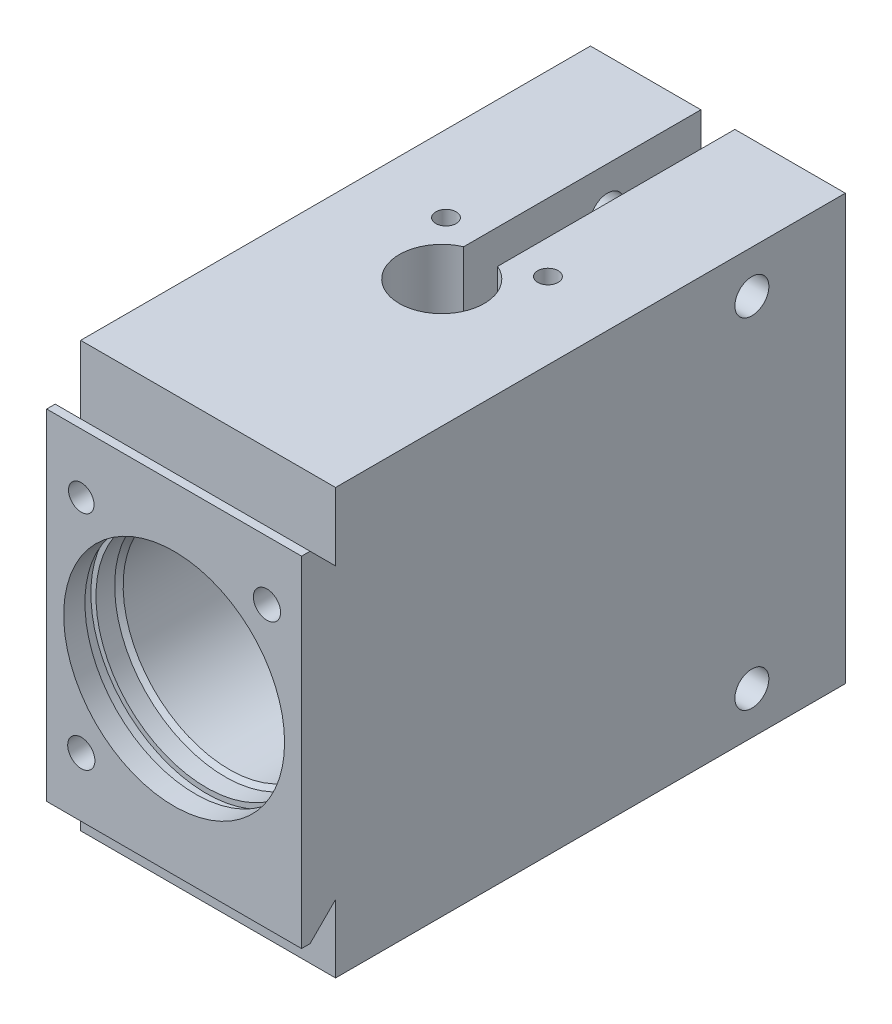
ISO-10303-21;
HEADER;
FILE_DESCRIPTION(('STEP AP214'),'2;1');
FILE_NAME('part.step','',(''),(''),'','','');
FILE_SCHEMA(('AUTOMOTIVE_DESIGN { 1 0 10303 214 1 1 1 1 }'));
ENDSEC;
DATA;
#1=APPLICATION_CONTEXT('core data for automotive mechanical design processes');
#2=APPLICATION_PROTOCOL_DEFINITION('international standard','automotive_design',2000,#1);
#3=PRODUCT_CONTEXT('',#1,'mechanical');
#4=PRODUCT('Part','Part','',(#3));
#5=PRODUCT_RELATED_PRODUCT_CATEGORY('part','',(#4));
#6=PRODUCT_DEFINITION_FORMATION('','',#4);
#7=PRODUCT_DEFINITION_CONTEXT('part definition',#1,'design');
#8=PRODUCT_DEFINITION('design','',#6,#7);
#9=PRODUCT_DEFINITION_SHAPE('','',#8);
#10=(LENGTH_UNIT() NAMED_UNIT(*) SI_UNIT(.MILLI.,.METRE.));
#11=(NAMED_UNIT(*) PLANE_ANGLE_UNIT() SI_UNIT($,.RADIAN.));
#12=(NAMED_UNIT(*) SI_UNIT($,.STERADIAN.) SOLID_ANGLE_UNIT());
#13=UNCERTAINTY_MEASURE_WITH_UNIT(LENGTH_MEASURE(1.E-05),#10,'distance_accuracy_value','');
#14=(GEOMETRIC_REPRESENTATION_CONTEXT(3) GLOBAL_UNCERTAINTY_ASSIGNED_CONTEXT((#13)) GLOBAL_UNIT_ASSIGNED_CONTEXT((#10,
#11,#12)) REPRESENTATION_CONTEXT('',''));
#15=CARTESIAN_POINT('',(0.,0.,0.));
#16=DIRECTION('',(0.,0.,1.));
#17=DIRECTION('',(1.,0.,0.));
#18=AXIS2_PLACEMENT_3D('',#15,#16,#17);
#19=CARTESIAN_POINT('',(0.,0.,58.));
#20=DIRECTION('',(0.,0.,1.));
#21=DIRECTION('',(1.,0.,0.));
#22=AXIS2_PLACEMENT_3D('',#19,#20,#21);
#23=CYLINDRICAL_SURFACE('',#22,13.);
#24=CARTESIAN_POINT('',(0.,0.,58.));
#25=DIRECTION('',(0.,0.,1.));
#26=DIRECTION('',(1.,0.,0.));
#27=AXIS2_PLACEMENT_3D('',#24,#25,#26);
#28=CIRCLE('',#27,13.);
#29=CARTESIAN_POINT('',(13.,0.,58.));
#30=VERTEX_POINT('',#29);
#31=EDGE_CURVE('E514',#30,#30,#28,.T.);
#32=ORIENTED_EDGE('',*,*,#31,.F.);
#33=EDGE_LOOP('',(#32));
#34=FACE_BOUND('',#33,.T.);
#35=CARTESIAN_POINT('',(0.,0.,60.2));
#36=DIRECTION('',(0.,0.,1.));
#37=DIRECTION('',(1.,0.,0.));
#38=AXIS2_PLACEMENT_3D('',#35,#36,#37);
#39=CIRCLE('',#38,13.);
#40=CARTESIAN_POINT('',(13.,0.,60.2));
#41=VERTEX_POINT('',#40);
#42=EDGE_CURVE('E36',#41,#41,#39,.F.);
#43=ORIENTED_EDGE('',*,*,#42,.F.);
#44=EDGE_LOOP('',(#43));
#45=FACE_BOUND('',#44,.T.);
#46=ADVANCED_FACE('F32',(#34,#45),#23,.F.);
#47=CARTESIAN_POINT('',(-15.,-25.,60.));
#48=DIRECTION('',(0.,1.,0.));
#49=DIRECTION('',(0.,0.,1.));
#50=AXIS2_PLACEMENT_3D('',#47,#48,#49);
#51=PLANE('',#50);
#52=CARTESIAN_POINT('',(-7.,-25.,31.));
#53=DIRECTION('',(0.,-1.,0.));
#54=DIRECTION('',(0.,0.,-1.));
#55=AXIS2_PLACEMENT_3D('',#52,#53,#54);
#56=CIRCLE('',#55,2.);
#57=CARTESIAN_POINT('',(-7.,-25.,29.));
#58=VERTEX_POINT('',#57);
#59=EDGE_CURVE('E1246',#58,#58,#56,.T.);
#60=ORIENTED_EDGE('',*,*,#59,.F.);
#61=EDGE_LOOP('',(#60));
#62=FACE_BOUND('',#61,.T.);
#63=CARTESIAN_POINT('',(7.,-25.,51.));
#64=DIRECTION('',(0.,-1.,0.));
#65=DIRECTION('',(0.,0.,-1.));
#66=AXIS2_PLACEMENT_3D('',#63,#64,#65);
#67=CIRCLE('',#66,2.);
#68=CARTESIAN_POINT('',(7.,-25.,49.));
#69=VERTEX_POINT('',#68);
#70=EDGE_CURVE('E1251',#69,#69,#67,.T.);
#71=ORIENTED_EDGE('',*,*,#70,.F.);
#72=EDGE_LOOP('',(#71));
#73=FACE_BOUND('',#72,.T.);
#74=DIRECTION('',(-1.,0.,0.));
#75=VECTOR('',#74,1.);
#76=CARTESIAN_POINT('',(-15.,-25.,21.));
#77=LINE('',#76,#75);
#78=CARTESIAN_POINT('',(2.,-25.,21.));
#79=VERTEX_POINT('',#78);
#80=CARTESIAN_POINT('',(-2.,-25.,21.));
#81=VERTEX_POINT('',#80);
#82=EDGE_CURVE('E506',#79,#81,#77,.T.);
#83=ORIENTED_EDGE('',*,*,#82,.F.);
#84=DIRECTION('',(0.,0.,-1.));
#85=VECTOR('',#84,1.);
#86=CARTESIAN_POINT('',(1.99999999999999,-25.,60.));
#87=LINE('',#86,#85);
#88=CARTESIAN_POINT('',(2.,-25.,0.));
#89=VERTEX_POINT('',#88);
#90=EDGE_CURVE('E503',#79,#89,#87,.T.);
#91=ORIENTED_EDGE('',*,*,#90,.T.);
#92=DIRECTION('',(1.,0.,0.));
#93=VECTOR('',#92,1.);
#94=CARTESIAN_POINT('',(-15.,-25.,0.));
#95=LINE('',#94,#93);
#96=CARTESIAN_POINT('',(15.,-25.,0.));
#97=VERTEX_POINT('',#96);
#98=EDGE_CURVE('E696',#89,#97,#95,.T.);
#99=ORIENTED_EDGE('',*,*,#98,.T.);
#100=DIRECTION('',(0.,0.,-1.));
#101=VECTOR('',#100,1.);
#102=CARTESIAN_POINT('',(15.,-25.,60.));
#103=LINE('',#102,#101);
#104=CARTESIAN_POINT('',(15.,-25.,60.));
#105=VERTEX_POINT('',#104);
#106=EDGE_CURVE('E643',#105,#97,#103,.T.);
#107=ORIENTED_EDGE('',*,*,#106,.F.);
#108=DIRECTION('',(1.,0.,0.));
#109=VECTOR('',#108,1.);
#110=CARTESIAN_POINT('',(-15.,-25.,60.));
#111=LINE('',#110,#109);
#112=CARTESIAN_POINT('',(-15.,-25.,60.));
#113=VERTEX_POINT('',#112);
#114=EDGE_CURVE('E668',#113,#105,#111,.T.);
#115=ORIENTED_EDGE('',*,*,#114,.F.);
#116=DIRECTION('',(0.,0.,-1.));
#117=VECTOR('',#116,1.);
#118=CARTESIAN_POINT('',(-15.,-25.,60.));
#119=LINE('',#118,#117);
#120=CARTESIAN_POINT('',(-15.,-25.,0.));
#121=VERTEX_POINT('',#120);
#122=EDGE_CURVE('E570',#113,#121,#119,.T.);
#123=ORIENTED_EDGE('',*,*,#122,.T.);
#124=CARTESIAN_POINT('',(-2.,-25.,0.));
#125=VERTEX_POINT('',#124);
#126=EDGE_CURVE('E648',#121,#125,#95,.T.);
#127=ORIENTED_EDGE('',*,*,#126,.T.);
#128=DIRECTION('',(0.,0.,1.));
#129=VECTOR('',#128,1.);
#130=CARTESIAN_POINT('',(-2.,-25.,60.));
#131=LINE('',#130,#129);
#132=EDGE_CURVE('E486',#125,#81,#131,.T.);
#133=ORIENTED_EDGE('',*,*,#132,.T.);
#134=EDGE_LOOP('',(#83,#91,#99,#107,#115,#123,#127,#133));
#135=FACE_BOUND('',#134,.T.);
#136=CARTESIAN_POINT('',(0.,-25.,24.));
#137=DIRECTION('',(0.,-1.,0.));
#138=DIRECTION('',(0.,0.,-1.));
#139=AXIS2_PLACEMENT_3D('',#136,#137,#138);
#140=CIRCLE('',#139,1.99999999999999);
#141=CARTESIAN_POINT('',(0.,-25.,22.));
#142=VERTEX_POINT('',#141);
#143=EDGE_CURVE('E360',#142,#142,#140,.T.);
#144=ORIENTED_EDGE('',*,*,#143,.F.);
#145=EDGE_LOOP('',(#144));
#146=FACE_BOUND('',#145,.T.);
#147=ADVANCED_FACE('F694',(#62,#73,#135,#146),#51,.F.);
#148=CARTESIAN_POINT('',(2.,-30.7948288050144,21.));
#149=DIRECTION('',(0.,0.,-1.));
#150=DIRECTION('',(-1.,0.,0.));
#151=AXIS2_PLACEMENT_3D('',#148,#149,#150);
#152=PLANE('',#151);
#153=DIRECTION('',(0.,1.,0.));
#154=VECTOR('',#153,1.);
#155=CARTESIAN_POINT('',(-1.99999999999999,28.5864347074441,21.));
#156=LINE('',#155,#154);
#157=CARTESIAN_POINT('',(-2.,12.3389626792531,21.));
#158=VERTEX_POINT('',#157);
#159=CARTESIAN_POINT('',(-2.,13.5,21.));
#160=VERTEX_POINT('',#159);
#161=EDGE_CURVE('E467',#158,#160,#156,.T.);
#162=ORIENTED_EDGE('',*,*,#161,.T.);
#163=DIRECTION('',(-1.,0.,0.));
#164=VECTOR('',#163,1.);
#165=CARTESIAN_POINT('',(-2.,13.5,21.));
#166=LINE('',#165,#164);
#167=CARTESIAN_POINT('',(2.,13.5,21.));
#168=VERTEX_POINT('',#167);
#169=EDGE_CURVE('E443',#168,#160,#166,.T.);
#170=ORIENTED_EDGE('',*,*,#169,.F.);
#171=DIRECTION('',(0.,-1.,0.));
#172=VECTOR('',#171,1.);
#173=CARTESIAN_POINT('',(2.,28.5864347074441,21.));
#174=LINE('',#173,#172);
#175=CARTESIAN_POINT('',(2.,12.3389626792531,21.));
#176=VERTEX_POINT('',#175);
#177=EDGE_CURVE('E466',#168,#176,#174,.T.);
#178=ORIENTED_EDGE('',*,*,#177,.T.);
#179=CARTESIAN_POINT('',(0.,0.,21.));
#180=DIRECTION('',(0.,0.,-1.));
#181=DIRECTION('',(-1.,0.,0.));
#182=AXIS2_PLACEMENT_3D('',#179,#180,#181);
#183=CIRCLE('',#182,12.5);
#184=EDGE_CURVE('E508',#176,#158,#183,.F.);
#185=ORIENTED_EDGE('',*,*,#184,.T.);
#186=EDGE_LOOP('',(#162,#170,#178,#185));
#187=FACE_BOUND('',#186,.T.);
#188=ADVANCED_FACE('F771',(#187),#152,.T.);
#189=CARTESIAN_POINT('',(-15.,25.,0.));
#190=DIRECTION('',(0.,0.,-1.));
#191=DIRECTION('',(-1.,0.,0.));
#192=AXIS2_PLACEMENT_3D('',#189,#190,#191);
#193=PLANE('',#192);
#194=CARTESIAN_POINT('',(10.0000000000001,19.9999999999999,0.));
#195=DIRECTION('',(0.,0.,-1.));
#196=DIRECTION('',(-1.,0.,0.));
#197=AXIS2_PLACEMENT_3D('',#194,#195,#196);
#198=CIRCLE('',#197,1.2);
#199=CARTESIAN_POINT('',(8.80000000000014,19.9999999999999,0.));
#200=VERTEX_POINT('',#199);
#201=EDGE_CURVE('E251',#200,#200,#198,.T.);
#202=ORIENTED_EDGE('',*,*,#201,.F.);
#203=EDGE_LOOP('',(#202));
#204=FACE_BOUND('',#203,.T.);
#205=DIRECTION('',(0.,-1.,0.));
#206=VECTOR('',#205,1.);
#207=CARTESIAN_POINT('',(2.,28.5864347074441,0.));
#208=LINE('',#207,#206);
#209=CARTESIAN_POINT('',(2.,25.,0.));
#210=VERTEX_POINT('',#209);
#211=CARTESIAN_POINT('',(2.,12.8452325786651,0.));
#212=VERTEX_POINT('',#211);
#213=EDGE_CURVE('E459',#210,#212,#208,.T.);
#214=ORIENTED_EDGE('',*,*,#213,.F.);
#215=DIRECTION('',(-1.,0.,0.));
#216=VECTOR('',#215,1.);
#217=CARTESIAN_POINT('',(-15.,25.,0.));
#218=LINE('',#217,#216);
#219=CARTESIAN_POINT('',(15.,25.,0.));
#220=VERTEX_POINT('',#219);
#221=EDGE_CURVE('E652',#220,#210,#218,.T.);
#222=ORIENTED_EDGE('',*,*,#221,.F.);
#223=DIRECTION('',(0.,1.,0.));
#224=VECTOR('',#223,1.);
#225=CARTESIAN_POINT('',(15.,-25.,0.));
#226=LINE('',#225,#224);
#227=EDGE_CURVE('E636',#97,#220,#226,.T.);
#228=ORIENTED_EDGE('',*,*,#227,.F.);
#229=ORIENTED_EDGE('',*,*,#98,.F.);
#230=CARTESIAN_POINT('',(2.,-12.8452325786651,0.));
#231=VERTEX_POINT('',#230);
#232=EDGE_CURVE('E455',#231,#89,#208,.T.);
#233=ORIENTED_EDGE('',*,*,#232,.F.);
#234=CARTESIAN_POINT('',(0.,0.,0.));
#235=DIRECTION('',(0.,0.,-1.));
#236=DIRECTION('',(-1.,0.,0.));
#237=AXIS2_PLACEMENT_3D('',#234,#235,#236);
#238=CIRCLE('',#237,13.);
#239=EDGE_CURVE('E524',#212,#231,#238,.T.);
#240=ORIENTED_EDGE('',*,*,#239,.F.);
#241=EDGE_LOOP('',(#214,#222,#228,#229,#233,#240));
#242=FACE_BOUND('',#241,.T.);
#243=ADVANCED_FACE('F658',(#204,#242),#193,.T.);
#244=CARTESIAN_POINT('',(0.,0.,18.));
#245=DIRECTION('',(0.,0.,-1.));
#246=DIRECTION('',(-1.,0.,0.));
#247=AXIS2_PLACEMENT_3D('',#244,#245,#246);
#248=CYLINDRICAL_SURFACE('',#247,13.);
#249=ORIENTED_EDGE('',*,*,#239,.T.);
#250=DIRECTION('',(0.,0.,-1.));
#251=VECTOR('',#250,1.);
#252=CARTESIAN_POINT('',(2.,-12.8452325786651,18.));
#253=LINE('',#252,#251);
#254=CARTESIAN_POINT('',(2.,-12.8452325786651,17.5));
#255=VERTEX_POINT('',#254);
#256=EDGE_CURVE('E495',#231,#255,#253,.F.);
#257=ORIENTED_EDGE('',*,*,#256,.T.);
#258=CARTESIAN_POINT('',(0.,0.,17.5));
#259=DIRECTION('',(0.,0.,-1.));
#260=DIRECTION('',(-1.,0.,0.));
#261=AXIS2_PLACEMENT_3D('',#258,#259,#260);
#262=CIRCLE('',#261,13.);
#263=CARTESIAN_POINT('',(2.,12.8452325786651,17.5));
#264=VERTEX_POINT('',#263);
#265=EDGE_CURVE('E569',#255,#264,#262,.F.);
#266=ORIENTED_EDGE('',*,*,#265,.T.);
#267=DIRECTION('',(0.,0.,-1.));
#268=VECTOR('',#267,1.);
#269=CARTESIAN_POINT('',(2.,12.8452325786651,18.));
#270=LINE('',#269,#268);
#271=EDGE_CURVE('E489',#264,#212,#270,.T.);
#272=ORIENTED_EDGE('',*,*,#271,.T.);
#273=EDGE_LOOP('',(#249,#257,#266,#272));
#274=FACE_BOUND('',#273,.T.);
#275=ADVANCED_FACE('F760',(#274),#248,.F.);
#276=CARTESIAN_POINT('',(0.,0.,18.));
#277=DIRECTION('',(0.,0.,-1.));
#278=DIRECTION('',(-1.,0.,0.));
#279=AXIS2_PLACEMENT_3D('',#276,#277,#278);
#280=CONICAL_SURFACE('',#279,12.5,0.785398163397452);
#281=ORIENTED_EDGE('',*,*,#265,.F.);
#282=CARTESIAN_POINT('',(2.,-22.0704605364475,8.33910587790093));
#283=CARTESIAN_POINT('',(2.,-21.2303676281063,9.17572855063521));
#284=CARTESIAN_POINT('',(2.,-20.3901188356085,10.0121951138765));
#285=CARTESIAN_POINT('',(2.,-18.7091627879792,11.6844484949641));
#286=CARTESIAN_POINT('',(2.,-17.8684556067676,12.5202353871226));
#287=CARTESIAN_POINT('',(2.,-16.606926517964,13.7731452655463));
#288=CARTESIAN_POINT('',(2.,-16.1864135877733,14.1905793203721));
#289=CARTESIAN_POINT('',(2.,-15.3451255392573,15.0251799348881));
#290=CARTESIAN_POINT('',(2.,-14.9243504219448,15.4423464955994));
#291=CARTESIAN_POINT('',(2.,-14.082413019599,16.2763911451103));
#292=CARTESIAN_POINT('',(2.,-13.6612506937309,16.6932691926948));
#293=CARTESIAN_POINT('',(2.,-12.8184801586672,17.526586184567));
#294=CARTESIAN_POINT('',(2.,-12.3968719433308,17.9430251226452));
#295=CARTESIAN_POINT('',(2.,-11.5527538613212,18.7756121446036));
#296=CARTESIAN_POINT('',(2.,-11.1302435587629,19.1917597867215));
#297=CARTESIAN_POINT('',(2.,-10.2844238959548,20.0231998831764));
#298=CARTESIAN_POINT('',(2.,-9.86111457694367,20.4384923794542));
#299=CARTESIAN_POINT('',(2.,-9.01348343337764,21.2677145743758));
#300=CARTESIAN_POINT('',(2.,-8.58916206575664,21.6816447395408));
#301=CARTESIAN_POINT('',(2.,-7.95129342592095,22.3011864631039));
#302=CARTESIAN_POINT('',(2.,-7.73842092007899,22.5074926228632));
#303=CARTESIAN_POINT('',(2.,-7.31209825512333,22.9195138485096));
#304=CARTESIAN_POINT('',(2.,-7.09864808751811,23.125228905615));
#305=CARTESIAN_POINT('',(2.,-6.67072060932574,23.5361688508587));
#306=CARTESIAN_POINT('',(2.,-6.45624229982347,23.7413926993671));
#307=CARTESIAN_POINT('',(2.,-6.02632213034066,24.150807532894));
#308=CARTESIAN_POINT('',(2.,-5.810880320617,24.3549985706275));
#309=CARTESIAN_POINT('',(2.,-5.3788047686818,24.7618599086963));
#310=CARTESIAN_POINT('',(2.,-5.16217180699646,24.964531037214));
#311=CARTESIAN_POINT('',(2.,-4.72702737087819,25.3679359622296));
#312=CARTESIAN_POINT('',(2.,-4.50851555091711,25.5686693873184));
#313=CARTESIAN_POINT('',(2.,-4.17849560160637,25.8677560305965));
#314=CARTESIAN_POINT('',(2.,-4.06799502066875,25.9672205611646));
#315=CARTESIAN_POINT('',(2.,-3.84615777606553,26.1652084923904));
#316=CARTESIAN_POINT('',(2.,-3.73482113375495,26.2637319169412));
#317=CARTESIAN_POINT('',(2.,-3.51116491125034,26.4595348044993));
#318=CARTESIAN_POINT('',(2.,-3.3988458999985,26.5568149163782));
#319=CARTESIAN_POINT('',(2.,-3.17287558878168,26.7498422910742));
#320=CARTESIAN_POINT('',(2.,-3.05922415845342,26.8455894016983));
#321=CARTESIAN_POINT('',(2.,-2.82994584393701,27.0352587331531));
#322=CARTESIAN_POINT('',(2.,-2.71431488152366,27.1291760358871));
#323=CARTESIAN_POINT('',(2.,-2.48084094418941,27.3141751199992));
#324=CARTESIAN_POINT('',(2.,-2.3629985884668,27.4052576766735));
#325=CARTESIAN_POINT('',(2.,-2.18387467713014,27.5389632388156));
#326=CARTESIAN_POINT('',(2.,-2.1237136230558,27.5830868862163));
#327=CARTESIAN_POINT('',(2.,-2.00251628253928,27.6701076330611));
#328=CARTESIAN_POINT('',(2.,-1.94148006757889,27.7130048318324));
#329=CARTESIAN_POINT('',(2.,-1.81832852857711,27.7973539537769));
#330=CARTESIAN_POINT('',(2.,-1.7562122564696,27.8388045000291));
#331=CARTESIAN_POINT('',(2.,-1.63076389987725,27.919859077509));
#332=CARTESIAN_POINT('',(2.,-1.56743147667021,27.9594625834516));
#333=CARTESIAN_POINT('',(2.,-1.50341252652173,27.997950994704));
#334=B_SPLINE_CURVE_WITH_KNOTS('',3,(#282,#283,#284,#285,#286,#287,#288,#289,#290,#291,#292,
#293,#294,#295,#296,#297,#298,#299,#300,#301,#302,#303,#304,#305,#306,#307,#308,#309,#310,#311,
#312,#313,#314,#315,#316,#317,#318,#319,#320,#321,#322,#323,#324,#325,#326,#327,#328,#329,#330,
#331,#332,#333),.UNSPECIFIED.,.F.,.F.,(4,2,2,2,2,2,2,2,2,2,2,2,2,2,2,2,2,2,2,2,2,2,2,2,2,4),(0.,
3.55685895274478,7.1132548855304,8.89082077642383,10.6683798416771,12.446154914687,
14.2239547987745,16.0030672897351,17.7820903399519,19.5604226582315,20.4497431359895,
21.3390767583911,22.229613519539,23.1201043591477,24.0100683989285,24.9001997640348,
25.3462138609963,25.7922166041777,26.2379762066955,26.6837797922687,27.1306507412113,
27.5773983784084,27.8012081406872,28.0249997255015,28.2489988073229,28.4730612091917),.UNSPECIFIED.);
#335=CARTESIAN_POINT('',(2.,-12.3389626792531,18.));
#336=VERTEX_POINT('',#335);
#337=EDGE_CURVE('E11',#255,#336,#334,.T.);
#338=ORIENTED_EDGE('',*,*,#337,.T.);
#339=CARTESIAN_POINT('',(0.,0.,18.));
#340=DIRECTION('',(0.,0.,-1.));
#341=DIRECTION('',(-1.,0.,0.));
#342=AXIS2_PLACEMENT_3D('',#339,#340,#341);
#343=CIRCLE('',#342,12.5);
#344=CARTESIAN_POINT('',(2.,12.3389626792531,18.));
#345=VERTEX_POINT('',#344);
#346=EDGE_CURVE('E520',#345,#336,#343,.T.);
#347=ORIENTED_EDGE('',*,*,#346,.F.);
#348=CARTESIAN_POINT('',(2.,1.50341252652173,27.997950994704));
#349=CARTESIAN_POINT('',(2.,1.55637475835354,27.966118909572));
#350=CARTESIAN_POINT('',(2.,1.60886355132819,27.933514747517));
#351=CARTESIAN_POINT('',(2.,1.7129900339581,27.8669938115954));
#352=CARTESIAN_POINT('',(2.,1.76462788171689,27.8330772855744));
#353=CARTESIAN_POINT('',(2.,1.91836495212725,27.729737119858));
#354=CARTESIAN_POINT('',(2.,2.01936302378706,27.6586767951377));
#355=CARTESIAN_POINT('',(2.,2.21888841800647,27.5135641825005));
#356=CARTESIAN_POINT('',(2.,2.31741983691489,27.4395174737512));
#357=CARTESIAN_POINT('',(2.,2.51271921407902,27.2890996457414));
#358=CARTESIAN_POINT('',(2.,2.60948679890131,27.212728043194));
#359=CARTESIAN_POINT('',(2.,2.80140991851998,27.0583936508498));
#360=CARTESIAN_POINT('',(2.,2.89656837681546,26.9804344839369));
#361=CARTESIAN_POINT('',(2.,3.08575910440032,26.8231607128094));
#362=CARTESIAN_POINT('',(2.,3.17979135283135,26.7438460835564));
#363=CARTESIAN_POINT('',(2.,3.36699238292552,26.584102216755));
#364=CARTESIAN_POINT('',(2.,3.46016065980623,26.5036723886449));
#365=CARTESIAN_POINT('',(2.,3.64574572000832,26.3419480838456));
#366=CARTESIAN_POINT('',(2.,3.73816248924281,26.2606535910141));
#367=CARTESIAN_POINT('',(2.,4.00605059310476,26.0231944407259));
#368=CARTESIAN_POINT('',(2.,4.18070231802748,25.8661054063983));
#369=CARTESIAN_POINT('',(2.,4.52838775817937,25.5501453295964));
#370=CARTESIAN_POINT('',(2.,4.70142143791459,25.3912742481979));
#371=CARTESIAN_POINT('',(2.,5.04629319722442,25.0722206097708));
#372=CARTESIAN_POINT('',(2.,5.21813120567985,24.9120379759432));
#373=CARTESIAN_POINT('',(2.,5.56088737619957,24.5906909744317));
#374=CARTESIAN_POINT('',(2.,5.73180553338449,24.4295266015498));
#375=CARTESIAN_POINT('',(2.,6.24346759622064,23.9449409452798));
#376=CARTESIAN_POINT('',(2.,6.58314950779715,23.6203988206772));
#377=CARTESIAN_POINT('',(2.,7.26070090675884,22.9694591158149));
#378=CARTESIAN_POINT('',(2.,7.5985704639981,22.6430616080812));
#379=CARTESIAN_POINT('',(2.,8.27410542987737,21.9880092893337));
#380=CARTESIAN_POINT('',(2.,8.61176710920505,21.6593506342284));
#381=CARTESIAN_POINT('',(2.,9.2862176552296,21.0011330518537));
#382=CARTESIAN_POINT('',(2.,9.623006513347,20.6715741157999));
#383=CARTESIAN_POINT('',(2.,10.6323951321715,19.681955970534));
#384=CARTESIAN_POINT('',(2.,11.3040449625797,19.0209281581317));
#385=CARTESIAN_POINT('',(2.,12.8206734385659,17.5250071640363));
#386=CARTESIAN_POINT('',(2.,13.6652244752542,16.6896809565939));
#387=CARTESIAN_POINT('',(2.,15.3530182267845,15.0176849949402));
#388=CARTESIAN_POINT('',(2.,16.1962609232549,14.1810152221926));
#389=CARTESIAN_POINT('',(2.,17.8783087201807,12.5104392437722));
#390=CARTESIAN_POINT('',(2.,18.717117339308,11.6765365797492));
#391=CARTESIAN_POINT('',(2.,20.3941565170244,10.0081770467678));
#392=CARTESIAN_POINT('',(2.,21.2323870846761,9.17372018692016));
#393=CARTESIAN_POINT('',(2.,22.0704605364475,8.33910587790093));
#394=B_SPLINE_CURVE_WITH_KNOTS('',3,(#348,#349,#350,#351,#352,#353,#354,#355,#356,#357,#358,
#359,#360,#361,#362,#363,#364,#365,#366,#367,#368,#369,#370,#371,#372,#373,#374,#375,#376,#377,
#378,#379,#380,#381,#382,#383,#384,#385,#386,#387,#388,#389,#390,#391,#392,#393),.UNSPECIFIED.,
.F.,.F.,(4,2,2,2,2,2,2,2,2,2,2,2,2,2,2,2,2,2,2,2,2,2,4),(0.,0.185357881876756,0.37068092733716,
0.741062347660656,1.11078125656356,1.48057755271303,1.84960800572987,2.21864528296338,
2.5878860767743,2.95713377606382,3.66182754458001,4.36653673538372,5.0712874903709,
5.77604198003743,7.18542632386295,8.59475594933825,10.0083613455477,11.4219805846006,
14.249101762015,17.812711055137,21.3763699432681,24.9247413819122,28.4730558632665),.UNSPECIFIED.);
#395=EDGE_CURVE('E41',#345,#264,#394,.T.);
#396=ORIENTED_EDGE('',*,*,#395,.T.);
#397=EDGE_LOOP('',(#281,#338,#347,#396));
#398=FACE_BOUND('',#397,.T.);
#399=ADVANCED_FACE('F755',(#398),#280,.F.);
#400=CARTESIAN_POINT('',(0.,0.,64.));
#401=DIRECTION('',(0.,0.,-1.));
#402=DIRECTION('',(-1.,0.,0.));
#403=AXIS2_PLACEMENT_3D('',#400,#401,#402);
#404=CYLINDRICAL_SURFACE('',#403,12.5);
#405=CARTESIAN_POINT('',(-7.,-10.356157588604,30.));
#406=CARTESIAN_POINT('',(-7.07038907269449,-10.3085786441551,30.000000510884));
#407=CARTESIAN_POINT('',(-7.14030983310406,-10.2602620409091,30.0074264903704));
#408=CARTESIAN_POINT('',(-7.2772041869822,-10.1636281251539,30.0366384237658));
#409=CARTESIAN_POINT('',(-7.34417388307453,-10.1153108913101,30.0584427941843));
#410=CARTESIAN_POINT('',(-7.47133243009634,-10.0217389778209,30.1153718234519));
#411=CARTESIAN_POINT('',(-7.53165753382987,-9.9764365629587,30.1501116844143));
#412=CARTESIAN_POINT('',(-7.64539620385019,-9.88954038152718,30.2329329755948));
#413=CARTESIAN_POINT('',(-7.69882502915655,-9.84793849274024,30.2809841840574));
#414=CARTESIAN_POINT('',(-7.78015377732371,-9.78370944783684,30.3724700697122));
#415=CARTESIAN_POINT('',(-7.8107043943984,-9.75931213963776,30.4123216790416));
#416=CARTESIAN_POINT('',(-7.86623832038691,-9.71460547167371,30.4977869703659));
#417=CARTESIAN_POINT('',(-7.89122973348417,-9.69429016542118,30.5433921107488));
#418=CARTESIAN_POINT('',(-7.93089972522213,-9.66185193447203,30.6320388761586));
#419=CARTESIAN_POINT('',(-7.94658557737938,-9.64894049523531,30.6743384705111));
#420=CARTESIAN_POINT('',(-7.97226807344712,-9.62773189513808,30.7617460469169));
#421=CARTESIAN_POINT('',(-7.98226787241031,-9.61943217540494,30.8068524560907));
#422=CARTESIAN_POINT('',(-7.99596597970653,-9.60804927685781,30.8988842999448));
#423=CARTESIAN_POINT('',(-7.99963592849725,-9.60498957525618,30.9458169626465));
#424=CARTESIAN_POINT('',(-8.00031208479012,-9.60442644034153,31.0397627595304));
#425=CARTESIAN_POINT('',(-7.99731909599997,-9.6069223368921,31.0867758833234));
#426=CARTESIAN_POINT('',(-7.98536582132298,-9.61685938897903,31.175849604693));
#427=CARTESIAN_POINT('',(-7.97686828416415,-9.62391696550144,31.2180177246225));
#428=CARTESIAN_POINT('',(-7.9548590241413,-9.64211700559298,31.3000842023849));
#429=CARTESIAN_POINT('',(-7.94134657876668,-9.65326005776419,31.3399822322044));
#430=CARTESIAN_POINT('',(-7.90884536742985,-9.67990876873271,31.4194901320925));
#431=CARTESIAN_POINT('',(-7.88953992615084,-9.6956648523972,31.4588850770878));
#432=CARTESIAN_POINT('',(-7.84671991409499,-9.73035188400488,31.5337889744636));
#433=CARTESIAN_POINT('',(-7.82320208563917,-9.74928528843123,31.5692948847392));
#434=CARTESIAN_POINT('',(-7.76106939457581,-9.79887815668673,31.6515462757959));
#435=CARTESIAN_POINT('',(-7.72047990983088,-9.83093083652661,31.6959697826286));
#436=CARTESIAN_POINT('',(-7.63370087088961,-9.89846683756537,31.7758299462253));
#437=CARTESIAN_POINT('',(-7.58750277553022,-9.9339553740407,31.8112526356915));
#438=CARTESIAN_POINT('',(-7.49029636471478,-10.0074581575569,31.8734875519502));
#439=CARTESIAN_POINT('',(-7.43923342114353,-10.0454991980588,31.9001821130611));
#440=CARTESIAN_POINT('',(-7.33400463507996,-10.1225804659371,31.9442969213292));
#441=CARTESIAN_POINT('',(-7.27983926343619,-10.1616205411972,31.9617185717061));
#442=CARTESIAN_POINT('',(-7.15997833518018,-10.2465101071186,31.989346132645));
#443=CARTESIAN_POINT('',(-7.09389240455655,-10.2923848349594,31.9978135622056));
#444=CARTESIAN_POINT('',(-6.96051665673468,-10.3830495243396,32.0014462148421));
#445=CARTESIAN_POINT('',(-6.89322581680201,-10.4278384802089,31.9965995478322));
#446=CARTESIAN_POINT('',(-6.75861809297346,-10.5155890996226,31.9728643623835));
#447=CARTESIAN_POINT('',(-6.69131191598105,-10.5585200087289,31.9537967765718));
#448=CARTESIAN_POINT('',(-6.56023757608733,-10.6404525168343,31.9008789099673));
#449=CARTESIAN_POINT('',(-6.49646315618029,-10.6794611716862,31.8670557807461));
#450=CARTESIAN_POINT('',(-6.39174610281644,-10.7423593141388,31.7955606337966));
#451=CARTESIAN_POINT('',(-6.34923223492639,-10.7675156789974,31.7612850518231));
#452=CARTESIAN_POINT('',(-6.26940015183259,-10.8141922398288,31.6850287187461));
#453=CARTESIAN_POINT('',(-6.23207932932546,-10.8357142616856,31.6430518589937));
#454=CARTESIAN_POINT('',(-6.16408785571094,-10.8745376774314,31.5518206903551));
#455=CARTESIAN_POINT('',(-6.13345842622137,-10.8918129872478,31.5025242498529));
#456=CARTESIAN_POINT('',(-6.08081567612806,-10.9212910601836,31.3981327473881));
#457=CARTESIAN_POINT('',(-6.05879749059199,-10.9334966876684,31.3430409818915));
#458=CARTESIAN_POINT('',(-6.02662020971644,-10.9512624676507,31.2352467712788));
#459=CARTESIAN_POINT('',(-6.01542207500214,-10.9574064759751,31.1829494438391));
#460=CARTESIAN_POINT('',(-6.00153177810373,-10.9650208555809,31.0769120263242));
#461=CARTESIAN_POINT('',(-5.99883521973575,-10.9664936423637,31.0231726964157));
#462=CARTESIAN_POINT('',(-6.00197349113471,-10.9647760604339,30.9198358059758));
#463=CARTESIAN_POINT('',(-6.00721980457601,-10.9619073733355,30.870213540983));
#464=CARTESIAN_POINT('',(-6.0249190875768,-10.9521893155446,30.7726833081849));
#465=CARTESIAN_POINT('',(-6.03737144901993,-10.9453402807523,30.7247751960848));
#466=CARTESIAN_POINT('',(-6.06895156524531,-10.9278612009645,30.6318062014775));
#467=CARTESIAN_POINT('',(-6.0880976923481,-10.9172207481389,30.5867535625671));
#468=CARTESIAN_POINT('',(-6.13224502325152,-10.8924840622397,30.5006567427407));
#469=CARTESIAN_POINT('',(-6.15724746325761,-10.878387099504,30.4596134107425));
#470=CARTESIAN_POINT('',(-6.21401286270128,-10.8460673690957,30.3796897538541));
#471=CARTESIAN_POINT('',(-6.24611651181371,-10.8276314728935,30.34113852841));
#472=CARTESIAN_POINT('',(-6.31475024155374,-10.787747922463,30.2700146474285));
#473=CARTESIAN_POINT('',(-6.35128210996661,-10.7662990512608,30.2374444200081));
#474=CARTESIAN_POINT('',(-6.43209318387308,-10.7182382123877,30.1751503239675));
#475=CARTESIAN_POINT('',(-6.47677947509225,-10.6913159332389,30.1461953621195));
#476=CARTESIAN_POINT('',(-6.56888860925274,-10.6349717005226,30.0961782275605));
#477=CARTESIAN_POINT('',(-6.61631266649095,-10.6055486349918,30.0751195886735));
#478=CARTESIAN_POINT('',(-6.71934781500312,-10.540614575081,30.0384281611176));
#479=CARTESIAN_POINT('',(-6.77518867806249,-10.5048224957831,30.0239380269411));
#480=CARTESIAN_POINT('',(-6.88745200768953,-10.4315632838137,30.0047201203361));
#481=CARTESIAN_POINT('',(-6.94387487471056,-10.3940949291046,29.9999995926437));
#482=CARTESIAN_POINT('',(-7.,-10.356157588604,30.));
#483=B_SPLINE_CURVE_WITH_KNOTS('',3,(#405,#406,#407,#408,#409,#410,#411,#412,#413,#414,#415,
#416,#417,#418,#419,#420,#421,#422,#423,#424,#425,#426,#427,#428,#429,#430,#431,#432,#433,#434,
#435,#436,#437,#438,#439,#440,#441,#442,#443,#444,#445,#446,#447,#448,#449,#450,#451,#452,#453,
#454,#455,#456,#457,#458,#459,#460,#461,#462,#463,#464,#465,#466,#467,#468,#469,#470,#471,#472,
#473,#474,#475,#476,#477,#478,#479,#480,#481,#482),.UNSPECIFIED.,.T.,.F.,(4,2,2,2,2,2,2,2,2,2,2,
2,2,2,2,2,2,2,2,2,2,2,2,2,2,2,2,2,2,2,2,2,2,2,2,2,2,2,4),(0.,0.25462618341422,0.509579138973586,
0.757485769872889,1.00483410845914,1.17171964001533,1.33836026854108,1.47855134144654,
1.6186645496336,1.75940389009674,1.90012625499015,2.03033028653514,2.16055308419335,
2.29987491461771,2.43930495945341,2.64273676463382,2.84648234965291,3.05287113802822,
3.25922868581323,3.50079757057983,3.74258225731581,3.9874639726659,4.23189697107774,
4.4115411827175,4.59109487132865,4.77172530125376,4.95225353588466,5.11289896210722,
5.27346130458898,5.42269501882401,5.57191614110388,5.72155008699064,5.87121564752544,
6.03090752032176,6.19066408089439,6.36895952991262,6.54733467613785,6.75021191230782,
6.95323954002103),.UNSPECIFIED.);
#484=CARTESIAN_POINT('',(-7.,-10.356157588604,30.));
#485=VERTEX_POINT('',#484);
#486=EDGE_CURVE('E1217',#485,#485,#483,.T.);
#487=ORIENTED_EDGE('',*,*,#486,.F.);
#488=EDGE_LOOP('',(#487));
#489=FACE_BOUND('',#488,.T.);
#490=CARTESIAN_POINT('',(7.,-10.356157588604,50.));
#491=CARTESIAN_POINT('',(6.92932676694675,-10.4039269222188,50.0000004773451));
#492=CARTESIAN_POINT('',(6.85813692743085,-10.4509819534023,50.007483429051));
#493=CARTESIAN_POINT('',(6.71724770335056,-10.5420867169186,50.0381108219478));
#494=CARTESIAN_POINT('',(6.64754621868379,-10.5861409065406,50.0612314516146));
#495=CARTESIAN_POINT('',(6.52932305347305,-10.6593404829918,50.1159171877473));
#496=CARTESIAN_POINT('',(6.47980671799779,-10.6894887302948,50.1440095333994));
#497=CARTESIAN_POINT('',(6.38501207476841,-10.7463792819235,50.209368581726));
#498=CARTESIAN_POINT('',(6.33973185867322,-10.7731231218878,50.2466311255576));
#499=CARTESIAN_POINT('',(6.25501720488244,-10.8225314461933,50.3302490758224));
#500=CARTESIAN_POINT('',(6.2156252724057,-10.8451665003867,50.3766654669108));
#501=CARTESIAN_POINT('',(6.14519209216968,-10.8852314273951,50.4774373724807));
#502=CARTESIAN_POINT('',(6.1141446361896,-10.9026651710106,50.5317869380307));
#503=CARTESIAN_POINT('',(6.06567282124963,-10.9296974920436,50.6393595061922));
#504=CARTESIAN_POINT('',(6.04701973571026,-10.9400095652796,50.6918503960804));
#505=CARTESIAN_POINT('',(6.01863921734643,-10.9556492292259,50.7998930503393));
#506=CARTESIAN_POINT('',(6.00890510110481,-10.9609805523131,50.8554424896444));
#507=CARTESIAN_POINT('',(5.9994324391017,-10.9661676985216,50.9620444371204));
#508=CARTESIAN_POINT('',(5.99879726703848,-10.9665146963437,51.0129957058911));
#509=CARTESIAN_POINT('',(6.00525467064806,-10.9629799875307,51.1142494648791));
#510=CARTESIAN_POINT('',(6.01234543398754,-10.9590992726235,51.1645521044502));
#511=CARTESIAN_POINT('',(6.03362476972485,-10.947397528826,51.261791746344));
#512=CARTESIAN_POINT('',(6.04762978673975,-10.9396783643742,51.3087816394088));
#513=CARTESIAN_POINT('',(6.08201298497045,-10.9205999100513,51.3995712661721));
#514=CARTESIAN_POINT('',(6.10239190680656,-10.9092401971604,51.4433706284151));
#515=CARTESIAN_POINT('',(6.1497184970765,-10.8826342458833,51.5286820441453));
#516=CARTESIAN_POINT('',(6.17691599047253,-10.8672388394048,51.5700083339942));
#517=CARTESIAN_POINT('',(6.23630351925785,-10.8332676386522,51.6474183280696));
#518=CARTESIAN_POINT('',(6.26849520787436,-10.814690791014,51.6835002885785));
#519=CARTESIAN_POINT('',(6.34020382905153,-10.7728223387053,51.7532682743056));
#520=CARTESIAN_POINT('',(6.38013073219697,-10.7492457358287,51.7863606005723));
#521=CARTESIAN_POINT('',(6.46341303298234,-10.6993762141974,51.8453896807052));
#522=CARTESIAN_POINT('',(6.5067700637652,-10.6730819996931,51.8713229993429));
#523=CARTESIAN_POINT('',(6.60182187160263,-10.6145873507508,51.9190505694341));
#524=CARTESIAN_POINT('',(6.65384721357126,-10.5820705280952,51.9397976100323));
#525=CARTESIAN_POINT('',(6.75937000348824,-10.5149814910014,51.972187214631));
#526=CARTESIAN_POINT('',(6.81286816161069,-10.4804082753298,51.9838253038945));
#527=CARTESIAN_POINT('',(6.92790866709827,-10.4047811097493,51.9993197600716));
#528=CARTESIAN_POINT('',(6.98949570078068,-10.3635128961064,52.0018076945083));
#529=CARTESIAN_POINT('',(7.11156802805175,-10.280130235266,51.9956372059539));
#530=CARTESIAN_POINT('',(7.17205231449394,-10.238015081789,51.9869690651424));
#531=CARTESIAN_POINT('',(7.29671166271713,-10.1496018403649,51.9573303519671));
#532=CARTESIAN_POINT('',(7.36062231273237,-10.103321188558,51.9351811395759));
#533=CARTESIAN_POINT('',(7.48369693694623,-10.0124981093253,51.877861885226));
#534=CARTESIAN_POINT('',(7.54286317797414,-9.96795485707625,51.8426981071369));
#535=CARTESIAN_POINT('',(7.64249615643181,-9.89167949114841,51.7682461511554));
#536=CARTESIAN_POINT('',(7.68426440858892,-9.85923680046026,51.7314234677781));
#537=CARTESIAN_POINT('',(7.76223406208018,-9.79796760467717,51.6497507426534));
#538=CARTESIAN_POINT('',(7.79844386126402,-9.76913565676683,51.6049130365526));
#539=CARTESIAN_POINT('',(7.8570613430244,-9.72202191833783,51.517335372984));
#540=CARTESIAN_POINT('',(7.88078008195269,-9.70278473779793,51.4759906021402));
#541=CARTESIAN_POINT('',(7.92256915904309,-9.66869307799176,51.3888397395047));
#542=CARTESIAN_POINT('',(7.94064238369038,-9.65383635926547,51.3430359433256));
#543=CARTESIAN_POINT('',(7.97018109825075,-9.62946460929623,51.2475178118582));
#544=CARTESIAN_POINT('',(7.98159161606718,-9.61999403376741,51.1977746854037));
#545=CARTESIAN_POINT('',(7.99666339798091,-9.60746983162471,51.0963462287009));
#546=CARTESIAN_POINT('',(8.00033168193,-9.60441039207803,51.0446627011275));
#547=CARTESIAN_POINT('',(7.99966765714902,-9.60496291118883,50.9483477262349));
#548=CARTESIAN_POINT('',(7.99634173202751,-9.60773569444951,50.9036994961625));
#549=CARTESIAN_POINT('',(7.98389083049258,-9.61808463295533,50.815802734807));
#550=CARTESIAN_POINT('',(7.97476589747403,-9.62566075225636,50.7725541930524));
#551=CARTESIAN_POINT('',(7.9513763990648,-9.64499029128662,50.6889516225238));
#552=CARTESIAN_POINT('',(7.93716228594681,-9.65670269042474,50.648573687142));
#553=CARTESIAN_POINT('',(7.90426430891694,-9.68364899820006,50.5709469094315));
#554=CARTESIAN_POINT('',(7.88557782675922,-9.69888496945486,50.5336999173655));
#555=CARTESIAN_POINT('',(7.8361880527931,-9.73886656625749,50.4485624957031));
#556=CARTESIAN_POINT('',(7.80366645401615,-9.76497959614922,50.4023649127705));
#557=CARTESIAN_POINT('',(7.73286584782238,-9.82114212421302,50.3173739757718));
#558=CARTESIAN_POINT('',(7.69457819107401,-9.85119752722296,50.2785919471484));
#559=CARTESIAN_POINT('',(7.61301879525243,-9.91436532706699,50.2080704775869));
#560=CARTESIAN_POINT('',(7.56968565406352,-9.94751413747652,50.1764354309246));
#561=CARTESIAN_POINT('',(7.47955915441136,-10.0154573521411,50.1208945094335));
#562=CARTESIAN_POINT('',(7.43276608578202,-10.0502516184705,50.0969879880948));
#563=CARTESIAN_POINT('',(7.32369471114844,-10.1301128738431,50.0515367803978));
#564=CARTESIAN_POINT('',(7.26062066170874,-10.1754396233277,50.0323317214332));
#565=CARTESIAN_POINT('',(7.1318508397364,-10.2661054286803,50.0065547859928));
#566=CARTESIAN_POINT('',(7.06615172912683,-10.3114444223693,49.9999995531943));
#567=CARTESIAN_POINT('',(7.,-10.356157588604,50.));
#568=B_SPLINE_CURVE_WITH_KNOTS('',3,(#490,#491,#492,#493,#494,#495,#496,#497,#498,#499,#500,
#501,#502,#503,#504,#505,#506,#507,#508,#509,#510,#511,#512,#513,#514,#515,#516,#517,#518,#519,
#520,#521,#522,#523,#524,#525,#526,#527,#528,#529,#530,#531,#532,#533,#534,#535,#536,#537,#538,
#539,#540,#541,#542,#543,#544,#545,#546,#547,#548,#549,#550,#551,#552,#553,#554,#555,#556,#557,
#558,#559,#560,#561,#562,#563,#564,#565,#566,#567),.UNSPECIFIED.,.T.,.F.,(4,2,2,2,2,2,2,2,2,2,2,
2,2,2,2,2,2,2,2,2,2,2,2,2,2,2,2,2,2,2,2,2,2,2,2,2,2,2,4),(0.,0.255602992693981,0.51081765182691,
0.703297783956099,0.89569078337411,1.08941169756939,1.28298808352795,1.45200192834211,
1.62088901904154,1.77300458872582,1.92508448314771,2.0733281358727,2.22158902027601,
2.37638126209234,2.5312248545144,2.70144436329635,2.87174540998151,3.0652778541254,
3.25890531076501,3.48052873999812,3.70234535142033,3.94708185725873,4.19170072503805,
4.38432275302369,4.57665083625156,4.73025648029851,4.88378345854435,5.03855987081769,
5.19319588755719,5.32710689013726,5.46101689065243,5.59363453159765,5.72633000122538,
5.91203918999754,6.09802977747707,6.28658292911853,6.47512030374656,6.71405627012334,
6.95330639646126),.UNSPECIFIED.);
#569=CARTESIAN_POINT('',(7.,-10.356157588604,50.));
#570=VERTEX_POINT('',#569);
#571=EDGE_CURVE('E1225',#570,#570,#568,.T.);
#572=ORIENTED_EDGE('',*,*,#571,.F.);
#573=EDGE_LOOP('',(#572));
#574=FACE_BOUND('',#573,.T.);
#575=CARTESIAN_POINT('',(0.,-12.5,22.));
#576=CARTESIAN_POINT('',(0.111577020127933,-12.4999981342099,22.0000045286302));
#577=CARTESIAN_POINT('',(0.223216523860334,-12.4984904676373,22.0093686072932));
#578=CARTESIAN_POINT('',(0.443368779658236,-12.4926212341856,22.046564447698));
#579=CARTESIAN_POINT('',(0.55187848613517,-12.4882569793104,22.0744136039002));
#580=CARTESIAN_POINT('',(0.762553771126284,-12.4771644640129,22.147720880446));
#581=CARTESIAN_POINT('',(0.864724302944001,-12.4704380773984,22.1931650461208));
#582=CARTESIAN_POINT('',(1.05997584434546,-12.4553623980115,22.3003367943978));
#583=CARTESIAN_POINT('',(1.15305798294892,-12.4470133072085,22.3620623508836));
#584=CARTESIAN_POINT('',(1.32832749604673,-12.4295364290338,22.5006256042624));
#585=CARTESIAN_POINT('',(1.41042286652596,-12.4204030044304,22.5775789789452));
#586=CARTESIAN_POINT('',(1.56059410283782,-12.4024303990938,22.744164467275));
#587=CARTESIAN_POINT('',(1.62866911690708,-12.393591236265,22.8337973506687));
#588=CARTESIAN_POINT('',(1.74923165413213,-12.377153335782,23.0238238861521));
#589=CARTESIAN_POINT('',(1.80162899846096,-12.369561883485,23.1242754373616));
#590=CARTESIAN_POINT('',(1.88877230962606,-12.3565566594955,23.3326956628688));
#591=CARTESIAN_POINT('',(1.92351937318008,-12.3511427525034,23.4406638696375));
#592=CARTESIAN_POINT('',(1.97408758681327,-12.3431614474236,23.6600803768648));
#593=CARTESIAN_POINT('',(1.99006704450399,-12.3405702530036,23.77149131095));
#594=CARTESIAN_POINT('',(2.00313711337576,-12.3384556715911,23.9954409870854));
#595=CARTESIAN_POINT('',(2.00022895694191,-12.3389320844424,24.1079796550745));
#596=CARTESIAN_POINT('',(1.97573547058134,-12.3428771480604,24.3298650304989));
#597=CARTESIAN_POINT('',(1.95432734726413,-12.3463174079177,24.439231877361));
#598=CARTESIAN_POINT('',(1.89371943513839,-12.3557581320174,24.652801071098));
#599=CARTESIAN_POINT('',(1.85451907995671,-12.36175867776,24.7570032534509));
#600=CARTESIAN_POINT('',(1.75925788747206,-12.375674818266,24.9578192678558));
#601=CARTESIAN_POINT('',(1.70312285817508,-12.3835988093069,25.0543972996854));
#602=CARTESIAN_POINT('',(1.57563852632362,-12.4004630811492,25.2368302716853));
#603=CARTESIAN_POINT('',(1.50428809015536,-12.4094034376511,25.3226844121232));
#604=CARTESIAN_POINT('',(1.34742984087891,-12.4274181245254,25.4822588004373));
#605=CARTESIAN_POINT('',(1.26176985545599,-12.4364928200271,25.5558295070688));
#606=CARTESIAN_POINT('',(1.07924037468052,-12.4536592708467,25.687574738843));
#607=CARTESIAN_POINT('',(0.982370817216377,-12.4617510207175,25.7457491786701));
#608=CARTESIAN_POINT('',(0.780035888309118,-12.4760500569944,25.845061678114));
#609=CARTESIAN_POINT('',(0.67456426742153,-12.4822559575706,25.8861872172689));
#610=CARTESIAN_POINT('',(0.458089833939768,-12.492072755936,25.950099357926));
#611=CARTESIAN_POINT('',(0.347087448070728,-12.4956838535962,25.9728873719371));
#612=CARTESIAN_POINT('',(0.123992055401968,-12.4998774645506,25.999276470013));
#613=CARTESIAN_POINT('',(0.0119239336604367,-12.5004923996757,26.0030829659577));
#614=CARTESIAN_POINT('',(-0.211249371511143,-12.4987129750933,25.9919476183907));
#615=CARTESIAN_POINT('',(-0.322354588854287,-12.4963187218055,25.9770064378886));
#616=CARTESIAN_POINT('',(-0.539818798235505,-12.4888100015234,25.9289707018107));
#617=CARTESIAN_POINT('',(-0.64620067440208,-12.4837106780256,25.8959771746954));
#618=CARTESIAN_POINT('',(-0.851922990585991,-12.4713614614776,25.8128805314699));
#619=CARTESIAN_POINT('',(-0.951263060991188,-12.4641114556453,25.7627765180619));
#620=CARTESIAN_POINT('',(-1.14097865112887,-12.4481852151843,25.6464060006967));
#621=CARTESIAN_POINT('',(-1.2312740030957,-12.4394977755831,25.5800103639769));
#622=CARTESIAN_POINT('',(-1.39951415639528,-12.4216959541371,25.4331198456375));
#623=CARTESIAN_POINT('',(-1.47745813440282,-12.4125815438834,25.3526240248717));
#624=CARTESIAN_POINT('',(-1.6195386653,-12.3948490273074,25.178899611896));
#625=CARTESIAN_POINT('',(-1.68353687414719,-12.3862364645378,25.0855572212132));
#626=CARTESIAN_POINT('',(-1.79494489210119,-12.3705841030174,24.8893262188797));
#627=CARTESIAN_POINT('',(-1.84235519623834,-12.3635442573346,24.7864378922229));
#628=CARTESIAN_POINT('',(-1.91903158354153,-12.3518754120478,24.5744330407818));
#629=CARTESIAN_POINT('',(-1.94836814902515,-12.3472370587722,24.4653425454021));
#630=CARTESIAN_POINT('',(-1.98828718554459,-12.3408723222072,24.243702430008));
#631=CARTESIAN_POINT('',(-1.99887114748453,-12.3391457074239,24.1311530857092));
#632=CARTESIAN_POINT('',(-2.00094546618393,-12.3388093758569,23.9071705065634));
#633=CARTESIAN_POINT('',(-1.99265347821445,-12.3401641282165,23.7957392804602));
#634=CARTESIAN_POINT('',(-1.95768017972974,-12.3457602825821,23.5758786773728));
#635=CARTESIAN_POINT('',(-1.93099891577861,-12.3500016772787,23.4674492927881));
#636=CARTESIAN_POINT('',(-1.86008521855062,-12.3608801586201,23.2567446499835));
#637=CARTESIAN_POINT('',(-1.81587007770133,-12.3675148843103,23.1544634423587));
#638=CARTESIAN_POINT('',(-1.71116577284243,-12.3824349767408,22.9587355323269));
#639=CARTESIAN_POINT('',(-1.65067590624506,-12.3907204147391,22.8652892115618));
#640=CARTESIAN_POINT('',(-1.51435663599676,-12.4081216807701,22.6887814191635));
#641=CARTESIAN_POINT('',(-1.43836664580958,-12.417245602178,22.6058447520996));
#642=CARTESIAN_POINT('',(-1.27354334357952,-12.4352300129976,22.4538246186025));
#643=CARTESIAN_POINT('',(-1.18470706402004,-12.44409044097,22.3847443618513));
#644=CARTESIAN_POINT('',(-0.996048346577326,-12.4606140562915,22.2620025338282));
#645=CARTESIAN_POINT('',(-0.89616004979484,-12.4682693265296,22.2084411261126));
#646=CARTESIAN_POINT('',(-0.688725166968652,-12.4814428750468,22.1189387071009));
#647=CARTESIAN_POINT('',(-0.581186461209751,-12.4869633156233,22.082979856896));
#648=CARTESIAN_POINT('',(-0.394335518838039,-12.4940175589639,22.0376542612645));
#649=CARTESIAN_POINT('',(-0.316163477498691,-12.4962491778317,22.0235560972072));
#650=CARTESIAN_POINT('',(-0.158671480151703,-12.4992410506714,22.0047274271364));
#651=CARTESIAN_POINT('',(-0.0793515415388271,-12.5000013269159,21.9999967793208));
#652=CARTESIAN_POINT('',(0.,-12.5,22.));
#653=B_SPLINE_CURVE_WITH_KNOTS('',3,(#575,#576,#577,#578,#579,#580,#581,#582,#583,#584,#585,
#586,#587,#588,#589,#590,#591,#592,#593,#594,#595,#596,#597,#598,#599,#600,#601,#602,#603,#604,
#605,#606,#607,#608,#609,#610,#611,#612,#613,#614,#615,#616,#617,#618,#619,#620,#621,#622,#623,
#624,#625,#626,#627,#628,#629,#630,#631,#632,#633,#634,#635,#636,#637,#638,#639,#640,#641,#642,
#643,#644,#645,#646,#647,#648,#649,#650,#651,#652),.UNSPECIFIED.,.T.,.F.,(4,2,2,2,2,2,2,2,2,2,2,
2,2,2,2,2,2,2,2,2,2,2,2,2,2,2,2,2,2,2,2,2,2,2,2,2,2,2,4),(0.,0.334441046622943,
0.669197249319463,1.00368849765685,1.33813814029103,1.67523334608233,2.01234902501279,
2.35136809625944,2.69036609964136,3.02648358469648,3.36257913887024,3.69549055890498,
4.0284125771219,4.36281487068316,4.69724208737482,5.03548313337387,5.37372605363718,
5.71221693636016,6.05068174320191,6.38547572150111,6.72025786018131,7.05318530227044,
7.38613020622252,7.72180459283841,8.05750134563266,8.39639027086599,8.73526908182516,
9.07281785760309,9.41033979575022,9.74398956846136,10.0776384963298,10.4109591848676,
10.7442942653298,11.0812763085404,11.4183363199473,11.7575256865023,12.0963705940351,
12.3342225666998,12.5720709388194),.UNSPECIFIED.);
#654=CARTESIAN_POINT('',(0.,-12.5,22.));
#655=VERTEX_POINT('',#654);
#656=EDGE_CURVE('E353',#655,#655,#653,.T.);
#657=ORIENTED_EDGE('',*,*,#656,.T.);
#658=EDGE_LOOP('',(#657));
#659=FACE_BOUND('',#658,.T.);
#660=ORIENTED_EDGE('',*,*,#346,.T.);
#661=DIRECTION('',(0.,0.,-1.));
#662=VECTOR('',#661,1.);
#663=CARTESIAN_POINT('',(2.,-12.3389626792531,64.));
#664=LINE('',#663,#662);
#665=CARTESIAN_POINT('',(2.,-12.3389626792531,21.));
#666=VERTEX_POINT('',#665);
#667=EDGE_CURVE('E498',#336,#666,#664,.F.);
#668=ORIENTED_EDGE('',*,*,#667,.T.);
#669=CARTESIAN_POINT('',(-2.,-12.3389626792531,21.));
#670=VERTEX_POINT('',#669);
#671=EDGE_CURVE('E510',#670,#666,#183,.F.);
#672=ORIENTED_EDGE('',*,*,#671,.F.);
#673=DIRECTION('',(0.,0.,-1.));
#674=VECTOR('',#673,1.);
#675=CARTESIAN_POINT('',(-2.,-12.3389626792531,64.));
#676=LINE('',#675,#674);
#677=CARTESIAN_POINT('',(-2.,-12.3389626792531,18.));
#678=VERTEX_POINT('',#677);
#679=EDGE_CURVE('E480',#670,#678,#676,.T.);
#680=ORIENTED_EDGE('',*,*,#679,.T.);
#681=CARTESIAN_POINT('',(-2.,12.3389626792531,18.));
#682=VERTEX_POINT('',#681);
#683=EDGE_CURVE('E517',#678,#682,#343,.T.);
#684=ORIENTED_EDGE('',*,*,#683,.T.);
#685=DIRECTION('',(0.,0.,-1.));
#686=VECTOR('',#685,1.);
#687=CARTESIAN_POINT('',(-2.,12.3389626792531,64.));
#688=LINE('',#687,#686);
#689=EDGE_CURVE('E474',#682,#158,#688,.F.);
#690=ORIENTED_EDGE('',*,*,#689,.T.);
#691=ORIENTED_EDGE('',*,*,#184,.F.);
#692=DIRECTION('',(0.,0.,-1.));
#693=VECTOR('',#692,1.);
#694=CARTESIAN_POINT('',(2.,12.3389626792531,64.));
#695=LINE('',#694,#693);
#696=EDGE_CURVE('E492',#176,#345,#695,.T.);
#697=ORIENTED_EDGE('',*,*,#696,.T.);
#698=EDGE_LOOP('',(#660,#668,#672,#680,#684,#690,#691,#697));
#699=FACE_BOUND('',#698,.T.);
#700=CARTESIAN_POINT('',(0.,0.,57.5));
#701=DIRECTION('',(0.,0.,1.));
#702=DIRECTION('',(1.,0.,0.));
#703=AXIS2_PLACEMENT_3D('',#700,#701,#702);
#704=CIRCLE('',#703,12.5);
#705=CARTESIAN_POINT('',(12.5,0.,57.5));
#706=VERTEX_POINT('',#705);
#707=EDGE_CURVE('E571',#706,#706,#704,.T.);
#708=ORIENTED_EDGE('',*,*,#707,.T.);
#709=EDGE_LOOP('',(#708));
#710=FACE_BOUND('',#709,.T.);
#711=ADVANCED_FACE('F765',(#489,#574,#659,#699,#710),#404,.F.);
#712=CARTESIAN_POINT('',(-15.,25.,60.));
#713=DIRECTION('',(0.,0.,-1.));
#714=DIRECTION('',(-1.,0.,0.));
#715=AXIS2_PLACEMENT_3D('',#712,#713,#714);
#716=PLANE('',#715);
#717=DIRECTION('',(1.,0.,0.));
#718=VECTOR('',#717,1.);
#719=CARTESIAN_POINT('',(-55.1995024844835,-17.,60.));
#720=LINE('',#719,#718);
#721=CARTESIAN_POINT('',(-15.,-17.,60.));
#722=VERTEX_POINT('',#721);
#723=CARTESIAN_POINT('',(15.,-17.,60.));
#724=VERTEX_POINT('',#723);
#725=EDGE_CURVE('E559',#722,#724,#720,.T.);
#726=ORIENTED_EDGE('',*,*,#725,.F.);
#727=DIRECTION('',(0.,-1.,0.));
#728=VECTOR('',#727,1.);
#729=CARTESIAN_POINT('',(-15.,-25.,60.));
#730=LINE('',#729,#728);
#731=EDGE_CURVE('E660',#722,#113,#730,.T.);
#732=ORIENTED_EDGE('',*,*,#731,.T.);
#733=ORIENTED_EDGE('',*,*,#114,.T.);
#734=DIRECTION('',(0.,1.,0.));
#735=VECTOR('',#734,1.);
#736=CARTESIAN_POINT('',(15.,-25.,60.));
#737=LINE('',#736,#735);
#738=EDGE_CURVE('E679',#105,#724,#737,.T.);
#739=ORIENTED_EDGE('',*,*,#738,.T.);
#740=EDGE_LOOP('',(#726,#732,#733,#739));
#741=FACE_BOUND('',#740,.T.);
#742=ADVANCED_FACE('F689',(#741),#716,.F.);
#743=CARTESIAN_POINT('',(-15.,-25.,60.));
#744=DIRECTION('',(1.,0.,0.));
#745=DIRECTION('',(0.,0.,-1.));
#746=AXIS2_PLACEMENT_3D('',#743,#744,#745);
#747=PLANE('',#746);
#748=DIRECTION('',(0.,-1.,0.));
#749=VECTOR('',#748,1.);
#750=CARTESIAN_POINT('',(-15.,10.,36.5));
#751=LINE('',#750,#749);
#752=CARTESIAN_POINT('',(-15.,9.99999999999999,36.5));
#753=VERTEX_POINT('',#752);
#754=CARTESIAN_POINT('',(-15.,-10.,36.5));
#755=VERTEX_POINT('',#754);
#756=EDGE_CURVE('E380',#753,#755,#751,.T.);
#757=ORIENTED_EDGE('',*,*,#756,.F.);
#758=CARTESIAN_POINT('',(-15.,10.,44.));
#759=DIRECTION('',(-1.,0.,0.));
#760=DIRECTION('',(0.,0.,1.));
#761=AXIS2_PLACEMENT_3D('',#758,#759,#760);
#762=CIRCLE('',#761,7.5);
#763=CARTESIAN_POINT('',(-15.,10.,51.5));
#764=VERTEX_POINT('',#763);
#765=EDGE_CURVE('E49',#764,#753,#762,.T.);
#766=ORIENTED_EDGE('',*,*,#765,.F.);
#767=DIRECTION('',(0.,1.,0.));
#768=VECTOR('',#767,1.);
#769=CARTESIAN_POINT('',(-15.,10.,51.5));
#770=LINE('',#769,#768);
#771=CARTESIAN_POINT('',(-15.,-10.,51.5));
#772=VERTEX_POINT('',#771);
#773=EDGE_CURVE('E386',#772,#764,#770,.T.);
#774=ORIENTED_EDGE('',*,*,#773,.F.);
#775=CARTESIAN_POINT('',(-15.,-10.,44.));
#776=DIRECTION('',(-1.,0.,0.));
#777=DIRECTION('',(0.,0.,1.));
#778=AXIS2_PLACEMENT_3D('',#775,#776,#777);
#779=CIRCLE('',#778,7.5);
#780=EDGE_CURVE('E383',#755,#772,#779,.T.);
#781=ORIENTED_EDGE('',*,*,#780,.F.);
#782=EDGE_LOOP('',(#757,#766,#774,#781));
#783=FACE_BOUND('',#782,.T.);
#784=CARTESIAN_POINT('',(-15.,-20.,11.));
#785=DIRECTION('',(-1.,0.,0.));
#786=DIRECTION('',(0.,0.,-1.));
#787=AXIS2_PLACEMENT_3D('',#784,#785,#786);
#788=CIRCLE('',#787,2.);
#789=CARTESIAN_POINT('',(-15.,-20.,9.));
#790=VERTEX_POINT('',#789);
#791=EDGE_CURVE('E404',#790,#790,#788,.T.);
#792=ORIENTED_EDGE('',*,*,#791,.F.);
#793=EDGE_LOOP('',(#792));
#794=FACE_BOUND('',#793,.T.);
#795=CARTESIAN_POINT('',(-15.,20.,11.));
#796=DIRECTION('',(-1.,0.,0.));
#797=DIRECTION('',(0.,0.,1.));
#798=AXIS2_PLACEMENT_3D('',#795,#796,#797);
#799=CIRCLE('',#798,2.);
#800=CARTESIAN_POINT('',(-15.,20.,13.));
#801=VERTEX_POINT('',#800);
#802=EDGE_CURVE('E418',#801,#801,#799,.T.);
#803=ORIENTED_EDGE('',*,*,#802,.F.);
#804=EDGE_LOOP('',(#803));
#805=FACE_BOUND('',#804,.T.);
#806=DIRECTION('',(0.,-1.,0.));
#807=VECTOR('',#806,1.);
#808=CARTESIAN_POINT('',(-15.,-25.,0.));
#809=LINE('',#808,#807);
#810=CARTESIAN_POINT('',(-15.,25.,0.));
#811=VERTEX_POINT('',#810);
#812=EDGE_CURVE('E707',#811,#121,#809,.T.);
#813=ORIENTED_EDGE('',*,*,#812,.T.);
#814=ORIENTED_EDGE('',*,*,#122,.F.);
#815=ORIENTED_EDGE('',*,*,#731,.F.);
#816=DIRECTION('',(0.,-0.707106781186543,0.707106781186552));
#817=VECTOR('',#816,1.);
#818=CARTESIAN_POINT('',(-15.,-20.,63.));
#819=LINE('',#818,#817);
#820=CARTESIAN_POINT('',(-15.,-20.,63.));
#821=VERTEX_POINT('',#820);
#822=EDGE_CURVE('E532',#722,#821,#819,.T.);
#823=ORIENTED_EDGE('',*,*,#822,.T.);
#824=DIRECTION('',(0.,0.,1.));
#825=VECTOR('',#824,1.);
#826=CARTESIAN_POINT('',(-15.,-20.,64.));
#827=LINE('',#826,#825);
#828=CARTESIAN_POINT('',(-15.,-20.,64.));
#829=VERTEX_POINT('',#828);
#830=EDGE_CURVE('E530',#821,#829,#827,.T.);
#831=ORIENTED_EDGE('',*,*,#830,.T.);
#832=DIRECTION('',(0.,1.,0.));
#833=VECTOR('',#832,1.);
#834=CARTESIAN_POINT('',(-15.,-20.,64.));
#835=LINE('',#834,#833);
#836=CARTESIAN_POINT('',(-15.,20.,64.));
#837=VERTEX_POINT('',#836);
#838=EDGE_CURVE('E527',#829,#837,#835,.T.);
#839=ORIENTED_EDGE('',*,*,#838,.T.);
#840=DIRECTION('',(0.,0.,-1.));
#841=VECTOR('',#840,1.);
#842=CARTESIAN_POINT('',(-15.,20.,64.));
#843=LINE('',#842,#841);
#844=CARTESIAN_POINT('',(-15.,20.,63.));
#845=VERTEX_POINT('',#844);
#846=EDGE_CURVE('E525',#837,#845,#843,.T.);
#847=ORIENTED_EDGE('',*,*,#846,.T.);
#848=DIRECTION('',(0.,-0.707106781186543,-0.707106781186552));
#849=VECTOR('',#848,1.);
#850=CARTESIAN_POINT('',(-15.,20.,63.));
#851=LINE('',#850,#849);
#852=CARTESIAN_POINT('',(-15.,17.,60.));
#853=VERTEX_POINT('',#852);
#854=EDGE_CURVE('E528',#845,#853,#851,.T.);
#855=ORIENTED_EDGE('',*,*,#854,.T.);
#856=CARTESIAN_POINT('',(-15.,25.,60.));
#857=VERTEX_POINT('',#856);
#858=EDGE_CURVE('E662',#857,#853,#730,.T.);
#859=ORIENTED_EDGE('',*,*,#858,.F.);
#860=DIRECTION('',(0.,0.,-1.));
#861=VECTOR('',#860,1.);
#862=CARTESIAN_POINT('',(-15.,25.,60.));
#863=LINE('',#862,#861);
#864=EDGE_CURVE('E655',#857,#811,#863,.T.);
#865=ORIENTED_EDGE('',*,*,#864,.T.);
#866=EDGE_LOOP('',(#813,#814,#815,#823,#831,#839,#847,#855,#859,#865));
#867=FACE_BOUND('',#866,.T.);
#868=ADVANCED_FACE('F34',(#783,#794,#805,#867),#747,.F.);
#869=CARTESIAN_POINT('',(15.,-25.,60.));
#870=DIRECTION('',(-1.,0.,0.));
#871=DIRECTION('',(0.,0.,1.));
#872=AXIS2_PLACEMENT_3D('',#869,#870,#871);
#873=PLANE('',#872);
#874=CARTESIAN_POINT('',(15.,-20.,11.));
#875=DIRECTION('',(-1.,0.,0.));
#876=DIRECTION('',(0.,0.,1.));
#877=AXIS2_PLACEMENT_3D('',#874,#875,#876);
#878=CIRCLE('',#877,2.);
#879=CARTESIAN_POINT('',(15.,-20.,13.));
#880=VERTEX_POINT('',#879);
#881=EDGE_CURVE('E415',#880,#880,#878,.T.);
#882=ORIENTED_EDGE('',*,*,#881,.T.);
#883=EDGE_LOOP('',(#882));
#884=FACE_BOUND('',#883,.T.);
#885=CARTESIAN_POINT('',(15.,20.,11.));
#886=DIRECTION('',(-1.,0.,0.));
#887=DIRECTION('',(0.,0.,1.));
#888=AXIS2_PLACEMENT_3D('',#885,#886,#887);
#889=CIRCLE('',#888,2.);
#890=CARTESIAN_POINT('',(15.,20.,13.));
#891=VERTEX_POINT('',#890);
#892=EDGE_CURVE('E425',#891,#891,#889,.T.);
#893=ORIENTED_EDGE('',*,*,#892,.T.);
#894=EDGE_LOOP('',(#893));
#895=FACE_BOUND('',#894,.T.);
#896=ORIENTED_EDGE('',*,*,#227,.T.);
#897=DIRECTION('',(0.,0.,-1.));
#898=VECTOR('',#897,1.);
#899=CARTESIAN_POINT('',(15.,25.,60.));
#900=LINE('',#899,#898);
#901=CARTESIAN_POINT('',(15.,25.,60.));
#902=VERTEX_POINT('',#901);
#903=EDGE_CURVE('E639',#902,#220,#900,.T.);
#904=ORIENTED_EDGE('',*,*,#903,.F.);
#905=CARTESIAN_POINT('',(15.,17.,60.));
#906=VERTEX_POINT('',#905);
#907=EDGE_CURVE('E683',#906,#902,#737,.T.);
#908=ORIENTED_EDGE('',*,*,#907,.F.);
#909=DIRECTION('',(0.,0.707106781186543,0.707106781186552));
#910=VECTOR('',#909,1.);
#911=CARTESIAN_POINT('',(15.,20.,63.));
#912=LINE('',#911,#910);
#913=CARTESIAN_POINT('',(15.,20.,63.));
#914=VERTEX_POINT('',#913);
#915=EDGE_CURVE('E541',#906,#914,#912,.T.);
#916=ORIENTED_EDGE('',*,*,#915,.T.);
#917=DIRECTION('',(0.,0.,1.));
#918=VECTOR('',#917,1.);
#919=CARTESIAN_POINT('',(15.,20.,64.));
#920=LINE('',#919,#918);
#921=CARTESIAN_POINT('',(15.,20.,64.));
#922=VERTEX_POINT('',#921);
#923=EDGE_CURVE('E537',#914,#922,#920,.T.);
#924=ORIENTED_EDGE('',*,*,#923,.T.);
#925=DIRECTION('',(0.,-1.,0.));
#926=VECTOR('',#925,1.);
#927=CARTESIAN_POINT('',(15.,-20.,64.));
#928=LINE('',#927,#926);
#929=CARTESIAN_POINT('',(15.,-20.,64.));
#930=VERTEX_POINT('',#929);
#931=EDGE_CURVE('E540',#922,#930,#928,.T.);
#932=ORIENTED_EDGE('',*,*,#931,.T.);
#933=DIRECTION('',(0.,0.,-1.));
#934=VECTOR('',#933,1.);
#935=CARTESIAN_POINT('',(15.,-20.,64.));
#936=LINE('',#935,#934);
#937=CARTESIAN_POINT('',(15.,-20.,63.));
#938=VERTEX_POINT('',#937);
#939=EDGE_CURVE('E533',#930,#938,#936,.T.);
#940=ORIENTED_EDGE('',*,*,#939,.T.);
#941=DIRECTION('',(0.,0.707106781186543,-0.707106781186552));
#942=VECTOR('',#941,1.);
#943=CARTESIAN_POINT('',(15.,-20.,63.));
#944=LINE('',#943,#942);
#945=EDGE_CURVE('E536',#938,#724,#944,.T.);
#946=ORIENTED_EDGE('',*,*,#945,.T.);
#947=ORIENTED_EDGE('',*,*,#738,.F.);
#948=ORIENTED_EDGE('',*,*,#106,.T.);
#949=EDGE_LOOP('',(#896,#904,#908,#916,#924,#932,#940,#946,#947,#948));
#950=FACE_BOUND('',#949,.T.);
#951=ADVANCED_FACE('F627',(#884,#895,#950),#873,.F.);
#952=CARTESIAN_POINT('',(-15.,25.,60.));
#953=DIRECTION('',(0.,-1.,0.));
#954=DIRECTION('',(0.,0.,-1.));
#955=AXIS2_PLACEMENT_3D('',#952,#953,#954);
#956=PLANE('',#955);
#957=CARTESIAN_POINT('',(6.,25.,26.));
#958=DIRECTION('',(0.,1.,0.));
#959=DIRECTION('',(0.,0.,1.));
#960=AXIS2_PLACEMENT_3D('',#957,#958,#959);
#961=CIRCLE('',#960,1.2);
#962=CARTESIAN_POINT('',(6.,25.,27.2));
#963=VERTEX_POINT('',#962);
#964=EDGE_CURVE('E431',#963,#963,#961,.T.);
#965=ORIENTED_EDGE('',*,*,#964,.F.);
#966=EDGE_LOOP('',(#965));
#967=FACE_BOUND('',#966,.T.);
#968=CARTESIAN_POINT('',(-6.,25.,26.));
#969=DIRECTION('',(0.,1.,0.));
#970=DIRECTION('',(0.,0.,1.));
#971=AXIS2_PLACEMENT_3D('',#968,#969,#970);
#972=CIRCLE('',#971,1.2);
#973=CARTESIAN_POINT('',(-6.,25.,27.2));
#974=VERTEX_POINT('',#973);
#975=EDGE_CURVE('E437',#974,#974,#972,.T.);
#976=ORIENTED_EDGE('',*,*,#975,.F.);
#977=EDGE_LOOP('',(#976));
#978=FACE_BOUND('',#977,.T.);
#979=DIRECTION('',(0.,0.,1.));
#980=VECTOR('',#979,1.);
#981=CARTESIAN_POINT('',(2.,25.,60.));
#982=LINE('',#981,#980);
#983=CARTESIAN_POINT('',(2.,25.,27.9174243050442));
#984=VERTEX_POINT('',#983);
#985=EDGE_CURVE('E501',#210,#984,#982,.T.);
#986=ORIENTED_EDGE('',*,*,#985,.T.);
#987=CARTESIAN_POINT('',(0.,25.,32.5));
#988=DIRECTION('',(0.,1.,0.));
#989=DIRECTION('',(0.,0.,1.));
#990=AXIS2_PLACEMENT_3D('',#987,#988,#989);
#991=CIRCLE('',#990,5.);
#992=CARTESIAN_POINT('',(-2.,25.,27.9174243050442));
#993=VERTEX_POINT('',#992);
#994=EDGE_CURVE('E440',#993,#984,#991,.T.);
#995=ORIENTED_EDGE('',*,*,#994,.F.);
#996=DIRECTION('',(0.,0.,-1.));
#997=VECTOR('',#996,1.);
#998=CARTESIAN_POINT('',(-1.99999999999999,25.,60.));
#999=LINE('',#998,#997);
#1000=CARTESIAN_POINT('',(-2.,25.,0.));
#1001=VERTEX_POINT('',#1000);
#1002=EDGE_CURVE('E483',#993,#1001,#999,.T.);
#1003=ORIENTED_EDGE('',*,*,#1002,.T.);
#1004=EDGE_CURVE('E647',#1001,#811,#218,.T.);
#1005=ORIENTED_EDGE('',*,*,#1004,.T.);
#1006=ORIENTED_EDGE('',*,*,#864,.F.);
#1007=DIRECTION('',(-1.,0.,0.));
#1008=VECTOR('',#1007,1.);
#1009=CARTESIAN_POINT('',(-15.,25.,60.));
#1010=LINE('',#1009,#1008);
#1011=EDGE_CURVE('E654',#902,#857,#1010,.T.);
#1012=ORIENTED_EDGE('',*,*,#1011,.F.);
#1013=ORIENTED_EDGE('',*,*,#903,.T.);
#1014=ORIENTED_EDGE('',*,*,#221,.T.);
#1015=EDGE_LOOP('',(#986,#995,#1003,#1005,#1006,#1012,#1013,#1014));
#1016=FACE_BOUND('',#1015,.T.);
#1017=ADVANCED_FACE('F630',(#967,#978,#1016),#956,.F.);
#1018=ORIENTED_EDGE('',*,*,#858,.T.);
#1019=DIRECTION('',(1.,0.,0.));
#1020=VECTOR('',#1019,1.);
#1021=CARTESIAN_POINT('',(-55.1995024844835,17.,60.));
#1022=LINE('',#1021,#1020);
#1023=EDGE_CURVE('E551',#853,#906,#1022,.T.);
#1024=ORIENTED_EDGE('',*,*,#1023,.T.);
#1025=ORIENTED_EDGE('',*,*,#907,.T.);
#1026=ORIENTED_EDGE('',*,*,#1011,.T.);
#1027=EDGE_LOOP('',(#1018,#1024,#1025,#1026));
#1028=FACE_BOUND('',#1027,.T.);
#1029=ADVANCED_FACE('F720',(#1028),#716,.F.);
#1030=CARTESIAN_POINT('',(-10.,-20.,0.));
#1031=DIRECTION('',(0.,0.,-1.));
#1032=DIRECTION('',(-1.,0.,0.));
#1033=AXIS2_PLACEMENT_3D('',#1030,#1031,#1032);
#1034=CIRCLE('',#1033,1.2);
#1035=CARTESIAN_POINT('',(-11.2,-20.,0.));
#1036=VERTEX_POINT('',#1035);
#1037=EDGE_CURVE('E254',#1036,#1036,#1034,.T.);
#1038=ORIENTED_EDGE('',*,*,#1037,.F.);
#1039=EDGE_LOOP('',(#1038));
#1040=FACE_BOUND('',#1039,.T.);
#1041=DIRECTION('',(0.,1.,0.));
#1042=VECTOR('',#1041,1.);
#1043=CARTESIAN_POINT('',(-1.99999999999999,28.5864347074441,0.));
#1044=LINE('',#1043,#1042);
#1045=CARTESIAN_POINT('',(-2.,-12.8452325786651,0.));
#1046=VERTEX_POINT('',#1045);
#1047=EDGE_CURVE('E462',#125,#1046,#1044,.T.);
#1048=ORIENTED_EDGE('',*,*,#1047,.F.);
#1049=ORIENTED_EDGE('',*,*,#126,.F.);
#1050=ORIENTED_EDGE('',*,*,#812,.F.);
#1051=ORIENTED_EDGE('',*,*,#1004,.F.);
#1052=CARTESIAN_POINT('',(-2.,12.8452325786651,0.));
#1053=VERTEX_POINT('',#1052);
#1054=EDGE_CURVE('E460',#1053,#1001,#1044,.T.);
#1055=ORIENTED_EDGE('',*,*,#1054,.F.);
#1056=EDGE_CURVE('E521',#1046,#1053,#238,.T.);
#1057=ORIENTED_EDGE('',*,*,#1056,.F.);
#1058=EDGE_LOOP('',(#1048,#1049,#1050,#1051,#1055,#1057));
#1059=FACE_BOUND('',#1058,.T.);
#1060=ADVANCED_FACE('F738',(#1040,#1059),#193,.T.);
#1061=CARTESIAN_POINT('',(-55.1995024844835,-20.,64.));
#1062=DIRECTION('',(0.,-1.,0.));
#1063=DIRECTION('',(0.,0.,-1.));
#1064=AXIS2_PLACEMENT_3D('',#1061,#1062,#1063);
#1065=PLANE('',#1064);
#1066=ORIENTED_EDGE('',*,*,#830,.F.);
#1067=DIRECTION('',(1.,0.,0.));
#1068=VECTOR('',#1067,1.);
#1069=CARTESIAN_POINT('',(-55.1995024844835,-20.,63.));
#1070=LINE('',#1069,#1068);
#1071=EDGE_CURVE('E544',#821,#938,#1070,.T.);
#1072=ORIENTED_EDGE('',*,*,#1071,.T.);
#1073=ORIENTED_EDGE('',*,*,#939,.F.);
#1074=DIRECTION('',(1.,0.,0.));
#1075=VECTOR('',#1074,1.);
#1076=CARTESIAN_POINT('',(-55.1995024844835,-20.,64.));
#1077=LINE('',#1076,#1075);
#1078=EDGE_CURVE('E545',#829,#930,#1077,.T.);
#1079=ORIENTED_EDGE('',*,*,#1078,.F.);
#1080=EDGE_LOOP('',(#1066,#1072,#1073,#1079));
#1081=FACE_BOUND('',#1080,.T.);
#1082=ADVANCED_FACE('F731',(#1081),#1065,.T.);
#1083=CARTESIAN_POINT('',(-55.1995024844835,-20.,64.));
#1084=DIRECTION('',(0.,0.,1.));
#1085=DIRECTION('',(1.,0.,0.));
#1086=AXIS2_PLACEMENT_3D('',#1083,#1084,#1085);
#1087=PLANE('',#1086);
#1088=CARTESIAN_POINT('',(-10.9273893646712,13.0227555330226,64.));
#1089=DIRECTION('',(0.,0.,1.));
#1090=DIRECTION('',(1.,0.,0.));
#1091=AXIS2_PLACEMENT_3D('',#1088,#1089,#1090);
#1092=CIRCLE('',#1091,1.5);
#1093=CARTESIAN_POINT('',(-9.4273893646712,13.0227555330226,64.));
#1094=VERTEX_POINT('',#1093);
#1095=EDGE_CURVE('E364',#1094,#1094,#1092,.T.);
#1096=ORIENTED_EDGE('',*,*,#1095,.F.);
#1097=EDGE_LOOP('',(#1096));
#1098=FACE_BOUND('',#1097,.T.);
#1099=CARTESIAN_POINT('',(-10.9273893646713,-13.0227555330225,64.));
#1100=DIRECTION('',(0.,0.,1.));
#1101=DIRECTION('',(1.,0.,0.));
#1102=AXIS2_PLACEMENT_3D('',#1099,#1100,#1101);
#1103=CIRCLE('',#1102,1.6);
#1104=CARTESIAN_POINT('',(-9.32738936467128,-13.0227555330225,64.));
#1105=VERTEX_POINT('',#1104);
#1106=EDGE_CURVE('E370',#1105,#1105,#1103,.T.);
#1107=ORIENTED_EDGE('',*,*,#1106,.F.);
#1108=EDGE_LOOP('',(#1107));
#1109=FACE_BOUND('',#1108,.T.);
#1110=CARTESIAN_POINT('',(10.9273893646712,13.0227555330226,64.));
#1111=DIRECTION('',(0.,0.,1.));
#1112=DIRECTION('',(1.,0.,0.));
#1113=AXIS2_PLACEMENT_3D('',#1110,#1111,#1112);
#1114=CIRCLE('',#1113,1.6);
#1115=CARTESIAN_POINT('',(12.5273893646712,13.0227555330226,64.));
#1116=VERTEX_POINT('',#1115);
#1117=EDGE_CURVE('E376',#1116,#1116,#1114,.T.);
#1118=ORIENTED_EDGE('',*,*,#1117,.F.);
#1119=EDGE_LOOP('',(#1118));
#1120=FACE_BOUND('',#1119,.T.);
#1121=CARTESIAN_POINT('',(0.,0.,64.));
#1122=DIRECTION('',(0.,0.,1.));
#1123=DIRECTION('',(1.,0.,0.));
#1124=AXIS2_PLACEMENT_3D('',#1121,#1122,#1123);
#1125=CIRCLE('',#1124,13.);
#1126=CARTESIAN_POINT('',(13.,0.,64.));
#1127=VERTEX_POINT('',#1126);
#1128=EDGE_CURVE('E511',#1127,#1127,#1125,.T.);
#1129=ORIENTED_EDGE('',*,*,#1128,.F.);
#1130=EDGE_LOOP('',(#1129));
#1131=FACE_BOUND('',#1130,.T.);
#1132=ORIENTED_EDGE('',*,*,#838,.F.);
#1133=ORIENTED_EDGE('',*,*,#1078,.T.);
#1134=ORIENTED_EDGE('',*,*,#931,.F.);
#1135=DIRECTION('',(1.,0.,0.));
#1136=VECTOR('',#1135,1.);
#1137=CARTESIAN_POINT('',(-55.1995024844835,20.,64.));
#1138=LINE('',#1137,#1136);
#1139=EDGE_CURVE('E547',#837,#922,#1138,.T.);
#1140=ORIENTED_EDGE('',*,*,#1139,.F.);
#1141=EDGE_LOOP('',(#1132,#1133,#1134,#1140));
#1142=FACE_BOUND('',#1141,.T.);
#1143=ADVANCED_FACE('F727',(#1098,#1109,#1120,#1131,#1142),#1087,.T.);
#1144=CARTESIAN_POINT('',(-55.1995024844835,20.,64.));
#1145=DIRECTION('',(0.,1.,0.));
#1146=DIRECTION('',(0.,0.,1.));
#1147=AXIS2_PLACEMENT_3D('',#1144,#1145,#1146);
#1148=PLANE('',#1147);
#1149=ORIENTED_EDGE('',*,*,#846,.F.);
#1150=ORIENTED_EDGE('',*,*,#1139,.T.);
#1151=ORIENTED_EDGE('',*,*,#923,.F.);
#1152=DIRECTION('',(1.,0.,0.));
#1153=VECTOR('',#1152,1.);
#1154=CARTESIAN_POINT('',(-55.1995024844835,20.,63.));
#1155=LINE('',#1154,#1153);
#1156=EDGE_CURVE('E549',#845,#914,#1155,.T.);
#1157=ORIENTED_EDGE('',*,*,#1156,.F.);
#1158=EDGE_LOOP('',(#1149,#1150,#1151,#1157));
#1159=FACE_BOUND('',#1158,.T.);
#1160=ADVANCED_FACE('F810',(#1159),#1148,.T.);
#1161=CARTESIAN_POINT('',(-55.1995024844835,20.,63.));
#1162=DIRECTION('',(0.,0.707106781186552,-0.707106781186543));
#1163=DIRECTION('',(0.,0.707106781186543,0.707106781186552));
#1164=AXIS2_PLACEMENT_3D('',#1161,#1162,#1163);
#1165=PLANE('',#1164);
#1166=ORIENTED_EDGE('',*,*,#854,.F.);
#1167=ORIENTED_EDGE('',*,*,#1156,.T.);
#1168=ORIENTED_EDGE('',*,*,#915,.F.);
#1169=ORIENTED_EDGE('',*,*,#1023,.F.);
#1170=EDGE_LOOP('',(#1166,#1167,#1168,#1169));
#1171=FACE_BOUND('',#1170,.T.);
#1172=ADVANCED_FACE('F719',(#1171),#1165,.T.);
#1173=CARTESIAN_POINT('',(-55.1995024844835,-20.,63.));
#1174=DIRECTION('',(0.,-0.707106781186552,-0.707106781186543));
#1175=DIRECTION('',(0.,0.707106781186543,-0.707106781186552));
#1176=AXIS2_PLACEMENT_3D('',#1173,#1174,#1175);
#1177=PLANE('',#1176);
#1178=ORIENTED_EDGE('',*,*,#822,.F.);
#1179=ORIENTED_EDGE('',*,*,#725,.T.);
#1180=ORIENTED_EDGE('',*,*,#945,.F.);
#1181=ORIENTED_EDGE('',*,*,#1071,.F.);
#1182=EDGE_LOOP('',(#1178,#1179,#1180,#1181));
#1183=FACE_BOUND('',#1182,.T.);
#1184=ADVANCED_FACE('F801',(#1183),#1177,.T.);
#1185=ORIENTED_EDGE('',*,*,#1056,.T.);
#1186=DIRECTION('',(0.,0.,-1.));
#1187=VECTOR('',#1186,1.);
#1188=CARTESIAN_POINT('',(-2.,12.8452325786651,18.));
#1189=LINE('',#1188,#1187);
#1190=CARTESIAN_POINT('',(-2.,12.8452325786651,17.5));
#1191=VERTEX_POINT('',#1190);
#1192=EDGE_CURVE('E471',#1053,#1191,#1189,.F.);
#1193=ORIENTED_EDGE('',*,*,#1192,.T.);
#1194=CARTESIAN_POINT('',(-2.,-12.8452325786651,17.5));
#1195=VERTEX_POINT('',#1194);
#1196=EDGE_CURVE('E566',#1191,#1195,#262,.F.);
#1197=ORIENTED_EDGE('',*,*,#1196,.T.);
#1198=DIRECTION('',(0.,0.,-1.));
#1199=VECTOR('',#1198,1.);
#1200=CARTESIAN_POINT('',(-2.,-12.8452325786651,18.));
#1201=LINE('',#1200,#1199);
#1202=EDGE_CURVE('E477',#1195,#1046,#1201,.T.);
#1203=ORIENTED_EDGE('',*,*,#1202,.T.);
#1204=EDGE_LOOP('',(#1185,#1193,#1197,#1203));
#1205=FACE_BOUND('',#1204,.T.);
#1206=ADVANCED_FACE('F746',(#1205),#248,.F.);
#1207=CARTESIAN_POINT('',(0.,0.,61.5));
#1208=DIRECTION('',(0.,0.,1.));
#1209=DIRECTION('',(1.,0.,0.));
#1210=AXIS2_PLACEMENT_3D('',#1207,#1208,#1209);
#1211=CIRCLE('',#1210,13.);
#1212=CARTESIAN_POINT('',(13.,0.,61.5));
#1213=VERTEX_POINT('',#1212);
#1214=EDGE_CURVE('E806',#1213,#1213,#1211,.F.);
#1215=ORIENTED_EDGE('',*,*,#1214,.T.);
#1216=EDGE_LOOP('',(#1215));
#1217=FACE_BOUND('',#1216,.T.);
#1218=ORIENTED_EDGE('',*,*,#1128,.T.);
#1219=EDGE_LOOP('',(#1218));
#1220=FACE_BOUND('',#1219,.T.);
#1221=ADVANCED_FACE('F787',(#1217,#1220),#23,.F.);
#1222=ORIENTED_EDGE('',*,*,#683,.F.);
#1223=CARTESIAN_POINT('',(-2.,-1.50341252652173,27.997950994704));
#1224=CARTESIAN_POINT('',(-2.,-1.55637475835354,27.9661189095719));
#1225=CARTESIAN_POINT('',(-2.,-1.60886355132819,27.933514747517));
#1226=CARTESIAN_POINT('',(-2.,-1.7129900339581,27.8669938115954));
#1227=CARTESIAN_POINT('',(-2.,-1.76462788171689,27.8330772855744));
#1228=CARTESIAN_POINT('',(-2.,-1.91836495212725,27.729737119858));
#1229=CARTESIAN_POINT('',(-2.,-2.01936302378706,27.6586767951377));
#1230=CARTESIAN_POINT('',(-2.,-2.21888841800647,27.5135641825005));
#1231=CARTESIAN_POINT('',(-2.,-2.31741983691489,27.4395174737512));
#1232=CARTESIAN_POINT('',(-2.,-2.51271921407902,27.2890996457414));
#1233=CARTESIAN_POINT('',(-2.,-2.60948679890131,27.212728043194));
#1234=CARTESIAN_POINT('',(-2.,-2.80140991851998,27.0583936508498));
#1235=CARTESIAN_POINT('',(-2.,-2.89656837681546,26.9804344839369));
#1236=CARTESIAN_POINT('',(-2.,-3.08575910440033,26.8231607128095));
#1237=CARTESIAN_POINT('',(-2.,-3.17979135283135,26.7438460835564));
#1238=CARTESIAN_POINT('',(-2.,-3.36699238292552,26.584102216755));
#1239=CARTESIAN_POINT('',(-2.,-3.46016065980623,26.5036723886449));
#1240=CARTESIAN_POINT('',(-2.,-3.64574572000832,26.3419480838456));
#1241=CARTESIAN_POINT('',(-2.,-3.73816248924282,26.2606535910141));
#1242=CARTESIAN_POINT('',(-2.,-4.00605059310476,26.0231944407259));
#1243=CARTESIAN_POINT('',(-2.,-4.18070231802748,25.8661054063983));
#1244=CARTESIAN_POINT('',(-2.,-4.52838775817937,25.5501453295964));
#1245=CARTESIAN_POINT('',(-2.,-4.7014214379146,25.3912742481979));
#1246=CARTESIAN_POINT('',(-2.,-5.04629319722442,25.0722206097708));
#1247=CARTESIAN_POINT('',(-2.,-5.21813120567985,24.9120379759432));
#1248=CARTESIAN_POINT('',(-2.,-5.56088737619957,24.5906909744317));
#1249=CARTESIAN_POINT('',(-2.,-5.73180553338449,24.4295266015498));
#1250=CARTESIAN_POINT('',(-2.,-6.24346759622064,23.9449409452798));
#1251=CARTESIAN_POINT('',(-2.,-6.58314950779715,23.6203988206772));
#1252=CARTESIAN_POINT('',(-2.,-7.26070090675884,22.9694591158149));
#1253=CARTESIAN_POINT('',(-2.,-7.5985704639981,22.6430616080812));
#1254=CARTESIAN_POINT('',(-2.,-8.27410542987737,21.9880092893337));
#1255=CARTESIAN_POINT('',(-2.,-8.61176710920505,21.6593506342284));
#1256=CARTESIAN_POINT('',(-2.,-9.2862176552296,21.0011330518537));
#1257=CARTESIAN_POINT('',(-2.,-9.623006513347,20.6715741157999));
#1258=CARTESIAN_POINT('',(-2.,-10.6323951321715,19.681955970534));
#1259=CARTESIAN_POINT('',(-2.,-11.3040449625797,19.0209281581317));
#1260=CARTESIAN_POINT('',(-2.,-12.8206734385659,17.5250071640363));
#1261=CARTESIAN_POINT('',(-2.,-13.6652244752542,16.6896809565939));
#1262=CARTESIAN_POINT('',(-2.,-15.3530182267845,15.0176849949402));
#1263=CARTESIAN_POINT('',(-2.,-16.1962609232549,14.1810152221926));
#1264=CARTESIAN_POINT('',(-2.,-17.8783087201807,12.5104392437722));
#1265=CARTESIAN_POINT('',(-2.,-18.717117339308,11.6765365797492));
#1266=CARTESIAN_POINT('',(-2.,-20.3941565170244,10.0081770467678));
#1267=CARTESIAN_POINT('',(-2.,-21.2323870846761,9.17372018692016));
#1268=CARTESIAN_POINT('',(-2.,-22.0704605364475,8.33910587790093));
#1269=B_SPLINE_CURVE_WITH_KNOTS('',3,(#1223,#1224,#1225,#1226,#1227,#1228,#1229,#1230,#1231,
#1232,#1233,#1234,#1235,#1236,#1237,#1238,#1239,#1240,#1241,#1242,#1243,#1244,#1245,#1246,#1247,
#1248,#1249,#1250,#1251,#1252,#1253,#1254,#1255,#1256,#1257,#1258,#1259,#1260,#1261,#1262,#1263,
#1264,#1265,#1266,#1267,#1268),.UNSPECIFIED.,.F.,.F.,(4,2,2,2,2,2,2,2,2,2,2,2,2,2,2,2,2,2,2,2,2,
2,4),(0.,0.185357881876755,0.370680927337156,0.741062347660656,1.11078125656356,
1.48057755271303,1.84960800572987,2.21864528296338,2.5878860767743,2.95713377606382,
3.66182754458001,4.36653673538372,5.0712874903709,5.77604198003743,7.18542632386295,
8.59475594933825,10.0083613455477,11.4219805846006,14.249101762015,17.812711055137,
21.376369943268,24.9247413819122,28.4730558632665),.UNSPECIFIED.);
#1270=EDGE_CURVE('E582',#678,#1195,#1269,.T.);
#1271=ORIENTED_EDGE('',*,*,#1270,.T.);
#1272=ORIENTED_EDGE('',*,*,#1196,.F.);
#1273=CARTESIAN_POINT('',(-2.,22.0704605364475,8.33910587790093));
#1274=CARTESIAN_POINT('',(-2.,21.2303676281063,9.17572855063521));
#1275=CARTESIAN_POINT('',(-2.,20.3901188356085,10.0121951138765));
#1276=CARTESIAN_POINT('',(-2.,18.7091627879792,11.6844484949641));
#1277=CARTESIAN_POINT('',(-2.,17.8684556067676,12.5202353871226));
#1278=CARTESIAN_POINT('',(-2.,16.606926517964,13.7731452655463));
#1279=CARTESIAN_POINT('',(-2.,16.1864135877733,14.1905793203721));
#1280=CARTESIAN_POINT('',(-2.,15.3451255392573,15.0251799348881));
#1281=CARTESIAN_POINT('',(-2.,14.9243504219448,15.4423464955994));
#1282=CARTESIAN_POINT('',(-2.,14.082413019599,16.2763911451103));
#1283=CARTESIAN_POINT('',(-2.,13.6612506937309,16.6932691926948));
#1284=CARTESIAN_POINT('',(-2.,12.8184801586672,17.526586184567));
#1285=CARTESIAN_POINT('',(-2.,12.3968719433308,17.9430251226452));
#1286=CARTESIAN_POINT('',(-2.,11.5527538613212,18.7756121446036));
#1287=CARTESIAN_POINT('',(-2.,11.1302435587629,19.1917597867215));
#1288=CARTESIAN_POINT('',(-2.,10.2844238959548,20.0231998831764));
#1289=CARTESIAN_POINT('',(-2.,9.86111457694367,20.4384923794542));
#1290=CARTESIAN_POINT('',(-2.,9.01348343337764,21.2677145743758));
#1291=CARTESIAN_POINT('',(-2.,8.58916206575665,21.6816447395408));
#1292=CARTESIAN_POINT('',(-2.,7.95129342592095,22.3011864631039));
#1293=CARTESIAN_POINT('',(-2.,7.73842092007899,22.5074926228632));
#1294=CARTESIAN_POINT('',(-2.,7.31209825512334,22.9195138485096));
#1295=CARTESIAN_POINT('',(-2.,7.09864808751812,23.125228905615));
#1296=CARTESIAN_POINT('',(-2.,6.67072060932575,23.5361688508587));
#1297=CARTESIAN_POINT('',(-2.,6.45624229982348,23.7413926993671));
#1298=CARTESIAN_POINT('',(-2.,6.02632213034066,24.150807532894));
#1299=CARTESIAN_POINT('',(-2.,5.810880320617,24.3549985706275));
#1300=CARTESIAN_POINT('',(-2.,5.3788047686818,24.7618599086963));
#1301=CARTESIAN_POINT('',(-2.,5.16217180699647,24.964531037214));
#1302=CARTESIAN_POINT('',(-2.,4.72702737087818,25.3679359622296));
#1303=CARTESIAN_POINT('',(-2.,4.50851555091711,25.5686693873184));
#1304=CARTESIAN_POINT('',(-2.,4.17849560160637,25.8677560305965));
#1305=CARTESIAN_POINT('',(-2.,4.06799502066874,25.9672205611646));
#1306=CARTESIAN_POINT('',(-2.,3.84615777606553,26.1652084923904));
#1307=CARTESIAN_POINT('',(-2.,3.73482113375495,26.2637319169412));
#1308=CARTESIAN_POINT('',(-2.,3.51116491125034,26.4595348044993));
#1309=CARTESIAN_POINT('',(-2.,3.39884589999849,26.5568149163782));
#1310=CARTESIAN_POINT('',(-2.,3.17287558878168,26.7498422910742));
#1311=CARTESIAN_POINT('',(-2.,3.05922415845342,26.8455894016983));
#1312=CARTESIAN_POINT('',(-2.,2.82994584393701,27.0352587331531));
#1313=CARTESIAN_POINT('',(-2.,2.71431488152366,27.1291760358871));
#1314=CARTESIAN_POINT('',(-2.,2.48084094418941,27.3141751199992));
#1315=CARTESIAN_POINT('',(-2.,2.3629985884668,27.4052576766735));
#1316=CARTESIAN_POINT('',(-2.,2.18387467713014,27.5389632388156));
#1317=CARTESIAN_POINT('',(-2.,2.12371362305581,27.5830868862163));
#1318=CARTESIAN_POINT('',(-2.,2.00251628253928,27.6701076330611));
#1319=CARTESIAN_POINT('',(-2.,1.9414800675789,27.7130048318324));
#1320=CARTESIAN_POINT('',(-2.,1.81832852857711,27.7973539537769));
#1321=CARTESIAN_POINT('',(-2.,1.75621225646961,27.8388045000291));
#1322=CARTESIAN_POINT('',(-2.,1.63076389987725,27.919859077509));
#1323=CARTESIAN_POINT('',(-2.,1.56743147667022,27.9594625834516));
#1324=CARTESIAN_POINT('',(-2.,1.50341252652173,27.997950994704));
#1325=B_SPLINE_CURVE_WITH_KNOTS('',3,(#1273,#1274,#1275,#1276,#1277,#1278,#1279,#1280,#1281,
#1282,#1283,#1284,#1285,#1286,#1287,#1288,#1289,#1290,#1291,#1292,#1293,#1294,#1295,#1296,#1297,
#1298,#1299,#1300,#1301,#1302,#1303,#1304,#1305,#1306,#1307,#1308,#1309,#1310,#1311,#1312,#1313,
#1314,#1315,#1316,#1317,#1318,#1319,#1320,#1321,#1322,#1323,#1324),.UNSPECIFIED.,.F.,.F.,(4,2,2,
2,2,2,2,2,2,2,2,2,2,2,2,2,2,2,2,2,2,2,2,2,2,4),(0.,3.55685895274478,7.1132548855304,
8.89082077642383,10.6683798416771,12.446154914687,14.2239547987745,16.0030672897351,
17.7820903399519,19.5604226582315,20.4497431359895,21.3390767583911,22.229613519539,
23.1201043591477,24.0100683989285,24.9001997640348,25.3462138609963,25.7922166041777,
26.2379762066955,26.6837797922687,27.1306507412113,27.5773983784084,27.8012081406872,
28.0249997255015,28.2489988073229,28.4730612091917),.UNSPECIFIED.);
#1326=EDGE_CURVE('E574',#1191,#682,#1325,.T.);
#1327=ORIENTED_EDGE('',*,*,#1326,.T.);
#1328=EDGE_LOOP('',(#1222,#1271,#1272,#1327));
#1329=FACE_BOUND('',#1328,.T.);
#1330=ADVANCED_FACE('F587',(#1329),#280,.F.);
#1331=CARTESIAN_POINT('',(0.,0.,58.));
#1332=DIRECTION('',(0.,0.,1.));
#1333=DIRECTION('',(1.,0.,0.));
#1334=AXIS2_PLACEMENT_3D('',#1331,#1332,#1333);
#1335=CONICAL_SURFACE('',#1334,13.,0.785398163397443);
#1336=ORIENTED_EDGE('',*,*,#707,.F.);
#1337=EDGE_LOOP('',(#1336));
#1338=FACE_BOUND('',#1337,.T.);
#1339=ORIENTED_EDGE('',*,*,#31,.T.);
#1340=EDGE_LOOP('',(#1339));
#1341=FACE_BOUND('',#1340,.T.);
#1342=ADVANCED_FACE('F607',(#1338,#1341),#1335,.F.);
#1343=CARTESIAN_POINT('',(-1.99999999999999,28.5864347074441,21.));
#1344=DIRECTION('',(-1.,0.,0.));
#1345=DIRECTION('',(0.,-1.,0.));
#1346=AXIS2_PLACEMENT_3D('',#1343,#1344,#1345);
#1347=PLANE('',#1346);
#1348=CARTESIAN_POINT('',(-1.99999999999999,20.,11.));
#1349=DIRECTION('',(-1.,0.,0.));
#1350=DIRECTION('',(0.,-1.,0.));
#1351=AXIS2_PLACEMENT_3D('',#1348,#1349,#1350);
#1352=CIRCLE('',#1351,2.);
#1353=CARTESIAN_POINT('',(-2.,18.,11.));
#1354=VERTEX_POINT('',#1353);
#1355=EDGE_CURVE('E422',#1354,#1354,#1352,.T.);
#1356=ORIENTED_EDGE('',*,*,#1355,.T.);
#1357=EDGE_LOOP('',(#1356));
#1358=FACE_BOUND('',#1357,.T.);
#1359=ORIENTED_EDGE('',*,*,#161,.F.);
#1360=ORIENTED_EDGE('',*,*,#689,.F.);
#1361=ORIENTED_EDGE('',*,*,#1326,.F.);
#1362=ORIENTED_EDGE('',*,*,#1192,.F.);
#1363=ORIENTED_EDGE('',*,*,#1054,.T.);
#1364=ORIENTED_EDGE('',*,*,#1002,.F.);
#1365=DIRECTION('',(0.,1.,0.));
#1366=VECTOR('',#1365,1.);
#1367=CARTESIAN_POINT('',(-2.,13.5,27.9174243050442));
#1368=LINE('',#1367,#1366);
#1369=CARTESIAN_POINT('',(-2.,13.5,27.9174243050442));
#1370=VERTEX_POINT('',#1369);
#1371=EDGE_CURVE('E451',#1370,#993,#1368,.T.);
#1372=ORIENTED_EDGE('',*,*,#1371,.F.);
#1373=DIRECTION('',(0.,0.,1.));
#1374=VECTOR('',#1373,1.);
#1375=CARTESIAN_POINT('',(-2.,13.5,21.));
#1376=LINE('',#1375,#1374);
#1377=EDGE_CURVE('E445',#160,#1370,#1376,.T.);
#1378=ORIENTED_EDGE('',*,*,#1377,.F.);
#1379=EDGE_LOOP('',(#1359,#1360,#1361,#1362,#1363,#1364,#1372,#1378));
#1380=FACE_BOUND('',#1379,.T.);
#1381=ADVANCED_FACE('F599',(#1358,#1380),#1347,.F.);
#1382=CARTESIAN_POINT('',(2.,28.5864347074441,21.));
#1383=DIRECTION('',(1.,0.,0.));
#1384=DIRECTION('',(0.,1.,0.));
#1385=AXIS2_PLACEMENT_3D('',#1382,#1383,#1384);
#1386=PLANE('',#1385);
#1387=CARTESIAN_POINT('',(2.,20.,11.));
#1388=DIRECTION('',(1.,0.,0.));
#1389=DIRECTION('',(0.,1.,0.));
#1390=AXIS2_PLACEMENT_3D('',#1387,#1388,#1389);
#1391=CIRCLE('',#1390,2.);
#1392=CARTESIAN_POINT('',(2.,22.,11.));
#1393=VERTEX_POINT('',#1392);
#1394=EDGE_CURVE('E421',#1393,#1393,#1391,.T.);
#1395=ORIENTED_EDGE('',*,*,#1394,.T.);
#1396=EDGE_LOOP('',(#1395));
#1397=FACE_BOUND('',#1396,.T.);
#1398=ORIENTED_EDGE('',*,*,#213,.T.);
#1399=ORIENTED_EDGE('',*,*,#271,.F.);
#1400=ORIENTED_EDGE('',*,*,#395,.F.);
#1401=ORIENTED_EDGE('',*,*,#696,.F.);
#1402=ORIENTED_EDGE('',*,*,#177,.F.);
#1403=DIRECTION('',(0.,0.,-1.));
#1404=VECTOR('',#1403,1.);
#1405=CARTESIAN_POINT('',(2.,13.5,27.9174243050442));
#1406=LINE('',#1405,#1404);
#1407=CARTESIAN_POINT('',(2.,13.5,27.9174243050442));
#1408=VERTEX_POINT('',#1407);
#1409=EDGE_CURVE('E57',#1408,#168,#1406,.T.);
#1410=ORIENTED_EDGE('',*,*,#1409,.F.);
#1411=DIRECTION('',(0.,1.,0.));
#1412=VECTOR('',#1411,1.);
#1413=CARTESIAN_POINT('',(2.,13.5,27.9174243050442));
#1414=LINE('',#1413,#1412);
#1415=EDGE_CURVE('E452',#1408,#984,#1414,.T.);
#1416=ORIENTED_EDGE('',*,*,#1415,.T.);
#1417=ORIENTED_EDGE('',*,*,#985,.F.);
#1418=EDGE_LOOP('',(#1398,#1399,#1400,#1401,#1402,#1410,#1416,#1417));
#1419=FACE_BOUND('',#1418,.T.);
#1420=ADVANCED_FACE('F606',(#1397,#1419),#1386,.F.);
#1421=ORIENTED_EDGE('',*,*,#671,.T.);
#1422=EDGE_CURVE('E463',#666,#79,#174,.T.);
#1423=ORIENTED_EDGE('',*,*,#1422,.T.);
#1424=ORIENTED_EDGE('',*,*,#82,.T.);
#1425=EDGE_CURVE('E470',#81,#670,#156,.T.);
#1426=ORIENTED_EDGE('',*,*,#1425,.T.);
#1427=EDGE_LOOP('',(#1421,#1423,#1424,#1426));
#1428=FACE_BOUND('',#1427,.T.);
#1429=ADVANCED_FACE('F600',(#1428),#152,.T.);
#1430=CARTESIAN_POINT('',(2.,-20.,11.));
#1431=DIRECTION('',(1.,0.,0.));
#1432=DIRECTION('',(0.,1.,0.));
#1433=AXIS2_PLACEMENT_3D('',#1430,#1431,#1432);
#1434=CIRCLE('',#1433,2.);
#1435=CARTESIAN_POINT('',(2.,-18.,11.));
#1436=VERTEX_POINT('',#1435);
#1437=EDGE_CURVE('E412',#1436,#1436,#1434,.T.);
#1438=ORIENTED_EDGE('',*,*,#1437,.T.);
#1439=EDGE_LOOP('',(#1438));
#1440=FACE_BOUND('',#1439,.T.);
#1441=ORIENTED_EDGE('',*,*,#1422,.F.);
#1442=ORIENTED_EDGE('',*,*,#667,.F.);
#1443=ORIENTED_EDGE('',*,*,#337,.F.);
#1444=ORIENTED_EDGE('',*,*,#256,.F.);
#1445=ORIENTED_EDGE('',*,*,#232,.T.);
#1446=ORIENTED_EDGE('',*,*,#90,.F.);
#1447=EDGE_LOOP('',(#1441,#1442,#1443,#1444,#1445,#1446));
#1448=FACE_BOUND('',#1447,.T.);
#1449=ADVANCED_FACE('F597',(#1440,#1448),#1386,.F.);
#1450=CARTESIAN_POINT('',(-2.,-20.,11.));
#1451=DIRECTION('',(-1.,0.,0.));
#1452=DIRECTION('',(0.,-1.,0.));
#1453=AXIS2_PLACEMENT_3D('',#1450,#1451,#1452);
#1454=CIRCLE('',#1453,2.);
#1455=CARTESIAN_POINT('',(-2.,-22.,11.));
#1456=VERTEX_POINT('',#1455);
#1457=EDGE_CURVE('E295',#1456,#1456,#1454,.T.);
#1458=ORIENTED_EDGE('',*,*,#1457,.T.);
#1459=EDGE_LOOP('',(#1458));
#1460=FACE_BOUND('',#1459,.T.);
#1461=ORIENTED_EDGE('',*,*,#1047,.T.);
#1462=ORIENTED_EDGE('',*,*,#1202,.F.);
#1463=ORIENTED_EDGE('',*,*,#1270,.F.);
#1464=ORIENTED_EDGE('',*,*,#679,.F.);
#1465=ORIENTED_EDGE('',*,*,#1425,.F.);
#1466=ORIENTED_EDGE('',*,*,#132,.F.);
#1467=EDGE_LOOP('',(#1461,#1462,#1463,#1464,#1465,#1466));
#1468=FACE_BOUND('',#1467,.T.);
#1469=ADVANCED_FACE('F591',(#1460,#1468),#1347,.F.);
#1470=CARTESIAN_POINT('',(0.,13.5,32.5));
#1471=DIRECTION('',(0.,1.,0.));
#1472=DIRECTION('',(0.,0.,1.));
#1473=AXIS2_PLACEMENT_3D('',#1470,#1471,#1472);
#1474=CYLINDRICAL_SURFACE('',#1473,5.);
#1475=ORIENTED_EDGE('',*,*,#994,.T.);
#1476=ORIENTED_EDGE('',*,*,#1415,.F.);
#1477=CARTESIAN_POINT('',(0.,13.5,32.5));
#1478=DIRECTION('',(0.,1.,0.));
#1479=DIRECTION('',(0.,0.,1.));
#1480=AXIS2_PLACEMENT_3D('',#1477,#1478,#1479);
#1481=CIRCLE('',#1480,5.);
#1482=EDGE_CURVE('E448',#1370,#1408,#1481,.T.);
#1483=ORIENTED_EDGE('',*,*,#1482,.F.);
#1484=ORIENTED_EDGE('',*,*,#1371,.T.);
#1485=EDGE_LOOP('',(#1475,#1476,#1483,#1484));
#1486=FACE_BOUND('',#1485,.T.);
#1487=ADVANCED_FACE('F596',(#1486),#1474,.F.);
#1488=CARTESIAN_POINT('',(0.,13.5,32.5));
#1489=DIRECTION('',(0.,1.,0.));
#1490=DIRECTION('',(0.,0.,1.));
#1491=AXIS2_PLACEMENT_3D('',#1488,#1489,#1490);
#1492=PLANE('',#1491);
#1493=ORIENTED_EDGE('',*,*,#169,.T.);
#1494=ORIENTED_EDGE('',*,*,#1377,.T.);
#1495=ORIENTED_EDGE('',*,*,#1482,.T.);
#1496=ORIENTED_EDGE('',*,*,#1409,.T.);
#1497=EDGE_LOOP('',(#1493,#1494,#1495,#1496));
#1498=FACE_BOUND('',#1497,.T.);
#1499=ADVANCED_FACE('F773',(#1498),#1492,.T.);
#1500=CARTESIAN_POINT('',(-6.,25.,26.));
#1501=DIRECTION('',(0.,1.,0.));
#1502=DIRECTION('',(0.,0.,1.));
#1503=AXIS2_PLACEMENT_3D('',#1500,#1501,#1502);
#1504=CYLINDRICAL_SURFACE('',#1503,1.2);
#1505=CARTESIAN_POINT('',(-6.,14.5,26.));
#1506=DIRECTION('',(0.,1.,0.));
#1507=DIRECTION('',(0.,0.,1.));
#1508=AXIS2_PLACEMENT_3D('',#1505,#1506,#1507);
#1509=CIRCLE('',#1508,1.2);
#1510=CARTESIAN_POINT('',(-6.,14.5,27.2));
#1511=VERTEX_POINT('',#1510);
#1512=EDGE_CURVE('E434',#1511,#1511,#1509,.T.);
#1513=ORIENTED_EDGE('',*,*,#1512,.F.);
#1514=EDGE_LOOP('',(#1513));
#1515=FACE_BOUND('',#1514,.T.);
#1516=ORIENTED_EDGE('',*,*,#975,.T.);
#1517=EDGE_LOOP('',(#1516));
#1518=FACE_BOUND('',#1517,.T.);
#1519=ADVANCED_FACE('F839',(#1515,#1518),#1504,.F.);
#1520=CARTESIAN_POINT('',(-6.,14.5,26.));
#1521=DIRECTION('',(0.,1.,0.));
#1522=DIRECTION('',(0.,0.,1.));
#1523=AXIS2_PLACEMENT_3D('',#1520,#1521,#1522);
#1524=CONICAL_SURFACE('',#1523,1.2,1.02974425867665);
#1525=CARTESIAN_POINT('',(-6.,13.7789672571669,26.));
#1526=VERTEX_POINT('',#1525);
#1527=VERTEX_LOOP('',#1526);
#1528=FACE_BOUND('',#1527,.T.);
#1529=ORIENTED_EDGE('',*,*,#1512,.T.);
#1530=EDGE_LOOP('',(#1529));
#1531=FACE_BOUND('',#1530,.T.);
#1532=ADVANCED_FACE('F841',(#1528,#1531),#1524,.F.);
#1533=CARTESIAN_POINT('',(6.,25.,26.));
#1534=DIRECTION('',(0.,1.,0.));
#1535=DIRECTION('',(0.,0.,1.));
#1536=AXIS2_PLACEMENT_3D('',#1533,#1534,#1535);
#1537=CYLINDRICAL_SURFACE('',#1536,1.2);
#1538=CARTESIAN_POINT('',(6.,14.5,26.));
#1539=DIRECTION('',(0.,1.,0.));
#1540=DIRECTION('',(0.,0.,1.));
#1541=AXIS2_PLACEMENT_3D('',#1538,#1539,#1540);
#1542=CIRCLE('',#1541,1.2);
#1543=CARTESIAN_POINT('',(6.,14.5,27.2));
#1544=VERTEX_POINT('',#1543);
#1545=EDGE_CURVE('E428',#1544,#1544,#1542,.T.);
#1546=ORIENTED_EDGE('',*,*,#1545,.F.);
#1547=EDGE_LOOP('',(#1546));
#1548=FACE_BOUND('',#1547,.T.);
#1549=ORIENTED_EDGE('',*,*,#964,.T.);
#1550=EDGE_LOOP('',(#1549));
#1551=FACE_BOUND('',#1550,.T.);
#1552=ADVANCED_FACE('F848',(#1548,#1551),#1537,.F.);
#1553=CARTESIAN_POINT('',(6.,14.5,26.));
#1554=DIRECTION('',(0.,1.,0.));
#1555=DIRECTION('',(0.,0.,1.));
#1556=AXIS2_PLACEMENT_3D('',#1553,#1554,#1555);
#1557=CONICAL_SURFACE('',#1556,1.2,1.02974425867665);
#1558=CARTESIAN_POINT('',(6.,13.7789672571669,26.));
#1559=VERTEX_POINT('',#1558);
#1560=VERTEX_LOOP('',#1559);
#1561=FACE_BOUND('',#1560,.T.);
#1562=ORIENTED_EDGE('',*,*,#1545,.T.);
#1563=EDGE_LOOP('',(#1562));
#1564=FACE_BOUND('',#1563,.T.);
#1565=ADVANCED_FACE('F623',(#1561,#1564),#1557,.F.);
#1566=CARTESIAN_POINT('',(15.00005,20.,11.));
#1567=DIRECTION('',(-1.,0.,0.));
#1568=DIRECTION('',(0.,0.,1.));
#1569=AXIS2_PLACEMENT_3D('',#1566,#1567,#1568);
#1570=CYLINDRICAL_SURFACE('',#1569,2.);
#1571=CARTESIAN_POINT('',(8.80000000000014,19.9999999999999,9.));
#1572=CARTESIAN_POINT('',(8.80000327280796,20.0613838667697,9.0000029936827));
#1573=CARTESIAN_POINT('',(8.80474293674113,20.1228658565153,9.00285676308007));
#1574=CARTESIAN_POINT('',(8.82345945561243,20.2439804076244,9.0140007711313));
#1575=CARTESIAN_POINT('',(8.83745908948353,20.3036080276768,9.0223044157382));
#1576=CARTESIAN_POINT('',(8.87390908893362,20.4190014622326,9.04350753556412));
#1577=CARTESIAN_POINT('',(8.89631756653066,20.4747848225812,9.05638421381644));
#1578=CARTESIAN_POINT('',(8.94868826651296,20.5816242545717,9.08563705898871));
#1579=CARTESIAN_POINT('',(8.97864861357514,20.632681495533,9.10201235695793));
#1580=CARTESIAN_POINT('',(9.047819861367,20.7330394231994,9.13835711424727));
#1581=CARTESIAN_POINT('',(9.08756295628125,20.7819072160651,9.15850566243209));
#1582=CARTESIAN_POINT('',(9.17397376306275,20.8727061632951,9.19975648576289));
#1583=CARTESIAN_POINT('',(9.22065034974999,20.9146282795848,9.2208599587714));
#1584=CARTESIAN_POINT('',(9.32633880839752,20.9955599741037,9.26471146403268));
#1585=CARTESIAN_POINT('',(9.38616141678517,21.0335821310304,9.28734385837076));
#1586=CARTESIAN_POINT('',(9.51267725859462,21.0988915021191,9.32849358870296));
#1587=CARTESIAN_POINT('',(9.57935911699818,21.1261961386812,9.34701758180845));
#1588=CARTESIAN_POINT('',(9.70127716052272,21.1635248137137,9.3731629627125));
#1589=CARTESIAN_POINT('',(9.75538879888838,21.1761295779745,9.38233693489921));
#1590=CARTESIAN_POINT('',(9.86544297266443,21.1937293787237,9.39527753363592));
#1591=CARTESIAN_POINT('',(9.92138314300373,21.1987338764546,9.39905088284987));
#1592=CARTESIAN_POINT('',(10.033609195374,21.200844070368,9.4006326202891));
#1593=CARTESIAN_POINT('',(10.0898955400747,21.1979342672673,9.3984293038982));
#1594=CARTESIAN_POINT('',(10.2010230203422,21.1843684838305,9.38837390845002));
#1595=CARTESIAN_POINT('',(10.2558630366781,21.1737066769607,9.38051758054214));
#1596=CARTESIAN_POINT('',(10.3620241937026,21.1453913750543,9.36037450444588));
#1597=CARTESIAN_POINT('',(10.4133816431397,21.1278299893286,9.34814630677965));
#1598=CARTESIAN_POINT('',(10.5125559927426,21.0863604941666,9.32058358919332));
#1599=CARTESIAN_POINT('',(10.5603715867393,21.0624500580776,9.30524793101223));
#1600=CARTESIAN_POINT('',(10.6599872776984,21.0041438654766,9.26995738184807));
#1601=CARTESIAN_POINT('',(10.7110224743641,20.9686457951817,9.24966365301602));
#1602=CARTESIAN_POINT('',(10.8069411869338,20.8903287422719,9.20855520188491));
#1603=CARTESIAN_POINT('',(10.8518187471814,20.8475027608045,9.18773999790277));
#1604=CARTESIAN_POINT('',(10.9404903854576,20.7486494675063,9.14451596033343));
#1605=CARTESIAN_POINT('',(10.9832618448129,20.6916141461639,9.1222893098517));
#1606=CARTESIAN_POINT('',(11.0584976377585,20.5698208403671,9.08182057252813));
#1607=CARTESIAN_POINT('',(11.0909674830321,20.5050670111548,9.06357635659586));
#1608=CARTESIAN_POINT('',(11.1423457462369,20.3737580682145,9.03415686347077));
#1609=CARTESIAN_POINT('',(11.1619802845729,20.3075740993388,9.02260834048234));
#1610=CARTESIAN_POINT('',(11.1896089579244,20.1720383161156,9.00624925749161));
#1611=CARTESIAN_POINT('',(11.197617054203,20.102690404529,9.00143061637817));
#1612=CARTESIAN_POINT('',(11.2012062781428,19.973028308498,8.99927543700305));
#1613=CARTESIAN_POINT('',(11.1983270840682,19.9127660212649,9.00101182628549));
#1614=CARTESIAN_POINT('',(11.1836593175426,19.7937364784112,9.00977030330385));
#1615=CARTESIAN_POINT('',(11.1718709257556,19.7349691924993,9.01679228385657));
#1616=CARTESIAN_POINT('',(11.14036525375,19.6219400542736,9.03524166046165));
#1617=CARTESIAN_POINT('',(11.1208477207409,19.5676033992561,9.04655779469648));
#1618=CARTESIAN_POINT('',(11.0746580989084,19.4629874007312,9.07268895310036));
#1619=CARTESIAN_POINT('',(11.0479845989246,19.4127088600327,9.08750466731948));
#1620=CARTESIAN_POINT('',(10.9851544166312,19.3119949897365,9.1212360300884));
#1621=CARTESIAN_POINT('',(10.9483009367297,19.2620846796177,9.14041757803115));
#1622=CARTESIAN_POINT('',(10.8676868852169,19.1687791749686,9.18020587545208));
#1623=CARTESIAN_POINT('',(10.823918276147,19.125391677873,9.2008142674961));
#1624=CARTESIAN_POINT('',(10.7240716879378,19.0405440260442,9.24443660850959));
#1625=CARTESIAN_POINT('',(10.6671328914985,19.000071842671,9.26741406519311));
#1626=CARTESIAN_POINT('',(10.5462271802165,18.9292380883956,9.31027054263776));
#1627=CARTESIAN_POINT('',(10.4822677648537,18.898865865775,9.33015281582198));
#1628=CARTESIAN_POINT('',(10.3630055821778,18.8548593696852,9.36012072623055));
#1629=CARTESIAN_POINT('',(10.3088157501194,18.8390269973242,9.37139472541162));
#1630=CARTESIAN_POINT('',(10.1979743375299,18.8150906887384,9.38872315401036));
#1631=CARTESIAN_POINT('',(10.1413262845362,18.8069760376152,9.39478481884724));
#1632=CARTESIAN_POINT('',(10.0268984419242,18.7989269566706,9.40079642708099));
#1633=CARTESIAN_POINT('',(9.96911520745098,18.7990232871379,9.40072338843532));
#1634=CARTESIAN_POINT('',(9.85448445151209,18.8074682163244,9.39441825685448));
#1635=CARTESIAN_POINT('',(9.79763745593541,18.8158213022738,9.38818281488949));
#1636=CARTESIAN_POINT('',(9.68920926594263,18.8396786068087,9.37093451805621));
#1637=CARTESIAN_POINT('',(9.63750632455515,18.8548189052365,9.36016630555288));
#1638=CARTESIAN_POINT('',(9.53733019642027,18.8914940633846,9.33515598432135));
#1639=CARTESIAN_POINT('',(9.48885823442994,18.9130313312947,9.32091256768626));
#1640=CARTESIAN_POINT('',(9.38854411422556,18.9656860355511,9.28789607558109));
#1641=CARTESIAN_POINT('',(9.3373271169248,18.9977666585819,9.26876329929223));
#1642=CARTESIAN_POINT('',(9.24049594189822,19.0689944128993,9.22943898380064));
#1643=CARTESIAN_POINT('',(9.19488643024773,19.1081473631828,9.20924658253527));
#1644=CARTESIAN_POINT('',(9.10291924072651,19.1999217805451,9.16619447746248));
#1645=CARTESIAN_POINT('',(9.05765514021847,19.2536985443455,9.14343752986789));
#1646=CARTESIAN_POINT('',(8.97672171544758,19.3692300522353,9.10107656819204));
#1647=CARTESIAN_POINT('',(8.94105583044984,19.4309876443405,9.08147368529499));
#1648=CARTESIAN_POINT('',(8.88177135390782,19.5590998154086,9.04811537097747));
#1649=CARTESIAN_POINT('',(8.85781754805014,19.6252559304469,9.03419938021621));
#1650=CARTESIAN_POINT('',(8.82182024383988,19.7616213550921,9.01306981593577));
#1651=CARTESIAN_POINT('',(8.80973186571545,19.8318143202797,9.00583099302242));
#1652=CARTESIAN_POINT('',(8.80264203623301,19.9187535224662,9.00158399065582));
#1653=CARTESIAN_POINT('',(8.80165246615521,19.9349789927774,9.00099108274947));
#1654=CARTESIAN_POINT('',(8.80033100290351,19.9674673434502,9.0001986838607));
#1655=CARTESIAN_POINT('',(8.79999913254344,19.9837302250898,8.99999920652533));
#1656=CARTESIAN_POINT('',(8.80000000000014,19.9999999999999,9.));
#1657=B_SPLINE_CURVE_WITH_KNOTS('',3,(#1571,#1572,#1573,#1574,#1575,#1576,#1577,#1578,#1579,
#1580,#1581,#1582,#1583,#1584,#1585,#1586,#1587,#1588,#1589,#1590,#1591,#1592,#1593,#1594,#1595,
#1596,#1597,#1598,#1599,#1600,#1601,#1602,#1603,#1604,#1605,#1606,#1607,#1608,#1609,#1610,#1611,
#1612,#1613,#1614,#1615,#1616,#1617,#1618,#1619,#1620,#1621,#1622,#1623,#1624,#1625,#1626,#1627,
#1628,#1629,#1630,#1631,#1632,#1633,#1634,#1635,#1636,#1637,#1638,#1639,#1640,#1641,#1642,#1643,
#1644,#1645,#1646,#1647,#1648,#1649,#1650,#1651,#1652,#1653,#1654,#1655,#1656),.UNSPECIFIED.,
.T.,.F.,(4,2,2,2,2,2,2,2,2,2,2,2,2,2,2,2,2,2,2,2,2,2,2,2,2,2,2,2,2,2,2,2,2,2,2,2,2,2,2,2,2,2,4),
(0.,0.184081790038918,0.368618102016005,0.552247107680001,0.735830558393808,0.933452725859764,
1.13133006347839,1.35347050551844,1.5752483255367,1.74347063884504,1.9114833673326,
2.07982536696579,2.24829402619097,2.41458614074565,2.58093927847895,2.7763759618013,
2.9720003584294,3.19488766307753,3.41765551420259,3.62637432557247,3.83484229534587,
4.01500482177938,4.19516369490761,4.37094228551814,4.54675556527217,4.74081092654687,
4.93509352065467,5.15469409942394,5.37406234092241,5.54606229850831,5.7178231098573,
5.89022740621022,6.06272544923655,6.22691278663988,6.39116201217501,6.58062888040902,
6.77025235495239,6.99083449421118,7.21149556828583,7.42540523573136,7.63850265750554,
7.68729178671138,7.73608260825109),.UNSPECIFIED.);
#1658=CARTESIAN_POINT('',(8.80000000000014,19.9999999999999,9.));
#1659=VERTEX_POINT('',#1658);
#1660=EDGE_CURVE('E250',#1659,#1659,#1657,.T.);
#1661=ORIENTED_EDGE('',*,*,#1660,.T.);
#1662=EDGE_LOOP('',(#1661));
#1663=FACE_BOUND('',#1662,.T.);
#1664=CARTESIAN_POINT('',(9.94812397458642,19.5496249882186,12.9486308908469));
#1665=CARTESIAN_POINT('',(9.96334424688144,19.5467631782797,12.9479694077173));
#1666=CARTESIAN_POINT('',(9.9788085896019,19.5451436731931,12.9475897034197));
#1667=CARTESIAN_POINT('',(10.009792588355,19.5445101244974,12.9474417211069));
#1668=CARTESIAN_POINT('',(10.0253122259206,19.5454952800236,12.9476732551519));
#1669=CARTESIAN_POINT('',(10.0559181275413,19.5499866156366,12.9487157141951));
#1670=CARTESIAN_POINT('',(10.0710053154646,19.553486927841,12.9495252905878));
#1671=CARTESIAN_POINT('',(10.1004306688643,19.5627518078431,12.9516240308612));
#1672=CARTESIAN_POINT('',(10.1147682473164,19.5685181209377,12.9529135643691));
#1673=CARTESIAN_POINT('',(10.146884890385,19.5841513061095,12.9563108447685));
#1674=CARTESIAN_POINT('',(10.1642986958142,19.5947397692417,12.9585483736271));
#1675=CARTESIAN_POINT('',(10.1971444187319,19.6185884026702,12.9633322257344));
#1676=CARTESIAN_POINT('',(10.2125725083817,19.6318536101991,12.9658791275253));
#1677=CARTESIAN_POINT('',(10.2451421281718,19.6642632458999,12.9717042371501));
#1678=CARTESIAN_POINT('',(10.2616567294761,19.6840345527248,12.9749976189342));
#1679=CARTESIAN_POINT('',(10.2912319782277,19.7260372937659,12.9812613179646));
#1680=CARTESIAN_POINT('',(10.3042909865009,19.748269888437,12.984231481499));
#1681=CARTESIAN_POINT('',(10.3269821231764,19.794777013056,12.9895820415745));
#1682=CARTESIAN_POINT('',(10.3365765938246,19.8190706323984,12.9919558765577));
#1683=CARTESIAN_POINT('',(10.3520250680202,19.8688747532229,12.9958532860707));
#1684=CARTESIAN_POINT('',(10.357879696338,19.8943850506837,12.9973770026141));
#1685=CARTESIAN_POINT('',(10.3661207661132,19.9484419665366,12.9995345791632));
#1686=CARTESIAN_POINT('',(10.368133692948,19.9770501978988,13.0000724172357));
#1687=CARTESIAN_POINT('',(10.3675269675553,20.0342160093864,12.9999117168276));
#1688=CARTESIAN_POINT('',(10.3649065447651,20.0627735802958,12.9992129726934));
#1689=CARTESIAN_POINT('',(10.3550555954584,20.1192568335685,12.996643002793));
#1690=CARTESIAN_POINT('',(10.3477896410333,20.1471759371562,12.9947627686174));
#1691=CARTESIAN_POINT('',(10.3287428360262,20.2013782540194,12.9900220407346));
#1692=CARTESIAN_POINT('',(10.3169575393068,20.2276598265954,12.987160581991));
#1693=CARTESIAN_POINT('',(10.2891375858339,20.2775256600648,12.9808096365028));
#1694=CARTESIAN_POINT('',(10.2731363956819,20.3011291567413,12.977325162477));
#1695=CARTESIAN_POINT('',(10.2369692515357,20.3448554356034,12.9701682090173));
#1696=CARTESIAN_POINT('',(10.216813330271,20.3649863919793,12.9664961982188));
#1697=CARTESIAN_POINT('',(10.1804052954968,20.3941087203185,12.9608201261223));
#1698=CARTESIAN_POINT('',(10.1653036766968,20.4045187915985,12.9586863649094));
#1699=CARTESIAN_POINT('',(10.1335907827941,20.4228201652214,12.9548172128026));
#1700=CARTESIAN_POINT('',(10.116981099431,20.4307140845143,12.9530814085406));
#1701=CARTESIAN_POINT('',(10.0823809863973,20.4434977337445,12.9502189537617));
#1702=CARTESIAN_POINT('',(10.0643784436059,20.4483567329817,12.9490985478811));
#1703=CARTESIAN_POINT('',(10.0277400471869,20.4544556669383,12.9476859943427));
#1704=CARTESIAN_POINT('',(10.0091049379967,20.4556997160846,12.9473929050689));
#1705=CARTESIAN_POINT('',(9.97474074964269,20.4545352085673,12.9476645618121));
#1706=CARTESIAN_POINT('',(9.95899069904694,20.4526411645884,12.9481084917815));
#1707=CARTESIAN_POINT('',(9.92804434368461,20.4462989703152,12.9495711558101));
#1708=CARTESIAN_POINT('',(9.91284818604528,20.4418501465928,12.9505900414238));
#1709=CARTESIAN_POINT('',(9.88332109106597,20.4306921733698,12.9530838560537));
#1710=CARTESIAN_POINT('',(9.86899232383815,20.4239776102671,12.9545598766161));
#1711=CARTESIAN_POINT('',(9.84143566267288,20.4086452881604,12.9578229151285));
#1712=CARTESIAN_POINT('',(9.8282084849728,20.400026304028,12.9596101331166));
#1713=CARTESIAN_POINT('',(9.79678707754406,20.376609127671,12.9642729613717));
#1714=CARTESIAN_POINT('',(9.77932257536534,20.3608490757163,12.9672537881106));
#1715=CARTESIAN_POINT('',(9.74720044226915,20.3266869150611,12.9732149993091));
#1716=CARTESIAN_POINT('',(9.73254756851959,20.3082804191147,12.9761953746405));
#1717=CARTESIAN_POINT('',(9.70593648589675,20.2691809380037,12.981902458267));
#1718=CARTESIAN_POINT('',(9.69402107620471,20.248458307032,12.9846247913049));
#1719=CARTESIAN_POINT('',(9.67324802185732,20.2054923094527,12.9895328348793));
#1720=CARTESIAN_POINT('',(9.66438942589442,20.1832494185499,12.9917187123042));
#1721=CARTESIAN_POINT('',(9.64862579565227,20.1339938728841,12.9956826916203));
#1722=CARTESIAN_POINT('',(9.64227148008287,20.1067931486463,12.9973369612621));
#1723=CARTESIAN_POINT('',(9.63392696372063,20.0516808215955,12.9995225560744));
#1724=CARTESIAN_POINT('',(9.63193841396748,20.0237689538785,13.0000534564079));
#1725=CARTESIAN_POINT('',(9.63238007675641,19.9670941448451,12.9999362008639));
#1726=CARTESIAN_POINT('',(9.63495225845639,19.9383322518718,12.9992501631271));
#1727=CARTESIAN_POINT('',(9.6447362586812,19.8816494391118,12.9966969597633));
#1728=CARTESIAN_POINT('',(9.65195018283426,19.8537289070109,12.994829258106));
#1729=CARTESIAN_POINT('',(9.67088686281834,19.7995161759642,12.9901125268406));
#1730=CARTESIAN_POINT('',(9.68261413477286,19.7732256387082,12.9872625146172));
#1731=CARTESIAN_POINT('',(9.71042678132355,19.7231414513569,12.9809050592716));
#1732=CARTESIAN_POINT('',(9.72650874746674,19.6993458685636,12.9773981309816));
#1733=CARTESIAN_POINT('',(9.75843937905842,19.6606614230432,12.9710747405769));
#1734=CARTESIAN_POINT('',(9.7733839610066,19.6450172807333,12.9682990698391));
#1735=CARTESIAN_POINT('',(9.80562082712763,19.6163161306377,12.9629057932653));
#1736=CARTESIAN_POINT('',(9.82291097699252,19.6032567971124,12.9602880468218));
#1737=CARTESIAN_POINT('',(9.85762578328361,19.5817520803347,12.9558057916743));
#1738=CARTESIAN_POINT('',(9.87482444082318,19.5729563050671,12.9538900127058));
#1739=CARTESIAN_POINT('',(9.91059920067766,19.5586778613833,12.9507150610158));
#1740=CARTESIAN_POINT('',(9.92917238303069,19.5531883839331,12.9494545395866));
#1741=CARTESIAN_POINT('',(9.94812397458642,19.5496249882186,12.9486308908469));
#1742=B_SPLINE_CURVE_WITH_KNOTS('',3,(#1664,#1665,#1666,#1667,#1668,#1669,#1670,#1671,#1672,
#1673,#1674,#1675,#1676,#1677,#1678,#1679,#1680,#1681,#1682,#1683,#1684,#1685,#1686,#1687,#1688,
#1689,#1690,#1691,#1692,#1693,#1694,#1695,#1696,#1697,#1698,#1699,#1700,#1701,#1702,#1703,#1704,
#1705,#1706,#1707,#1708,#1709,#1710,#1711,#1712,#1713,#1714,#1715,#1716,#1717,#1718,#1719,#1720,
#1721,#1722,#1723,#1724,#1725,#1726,#1727,#1728,#1729,#1730,#1731,#1732,#1733,#1734,#1735,#1736,
#1737,#1738,#1739,#1740,#1741),.UNSPECIFIED.,.T.,.F.,(4,2,2,2,2,2,2,2,2,2,2,2,2,2,2,2,2,2,2,2,2,
2,2,2,2,2,2,2,2,2,2,2,2,2,2,2,2,2,4),(0.,0.0464409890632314,0.0928677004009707,
0.139186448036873,0.185540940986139,0.246715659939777,0.308006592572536,0.385516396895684,
0.463062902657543,0.541428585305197,0.61978117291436,0.705426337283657,0.791085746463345,
0.877406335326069,0.963812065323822,1.04955153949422,1.13508634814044,1.19028758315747,
1.24543121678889,1.30112453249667,1.35675443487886,1.4041311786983,1.45152041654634,
1.49902369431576,1.54655762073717,1.61731008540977,1.68818122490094,1.76009465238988,
1.8319856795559,1.9155492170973,1.99914435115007,2.08538754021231,2.17166987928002,
2.25803877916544,2.3443402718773,2.40954397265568,2.47468873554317,2.53263469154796,
2.59046090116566),.UNSPECIFIED.);
#1743=CARTESIAN_POINT('',(9.94812397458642,19.5496249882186,12.9486308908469));
#1744=VERTEX_POINT('',#1743);
#1745=EDGE_CURVE('E248',#1744,#1744,#1742,.T.);
#1746=ORIENTED_EDGE('',*,*,#1745,.T.);
#1747=EDGE_LOOP('',(#1746));
#1748=FACE_BOUND('',#1747,.T.);
#1749=ORIENTED_EDGE('',*,*,#1394,.F.);
#1750=EDGE_LOOP('',(#1749));
#1751=FACE_BOUND('',#1750,.T.);
#1752=ORIENTED_EDGE('',*,*,#892,.F.);
#1753=EDGE_LOOP('',(#1752));
#1754=FACE_BOUND('',#1753,.T.);
#1755=ADVANCED_FACE('F271',(#1663,#1748,#1751,#1754),#1570,.F.);
#1756=ORIENTED_EDGE('',*,*,#802,.T.);
#1757=EDGE_LOOP('',(#1756));
#1758=FACE_BOUND('',#1757,.T.);
#1759=ORIENTED_EDGE('',*,*,#1355,.F.);
#1760=EDGE_LOOP('',(#1759));
#1761=FACE_BOUND('',#1760,.T.);
#1762=ADVANCED_FACE('F622',(#1758,#1761),#1570,.F.);
#1763=CARTESIAN_POINT('',(15.00005,-20.,11.));
#1764=DIRECTION('',(-1.,0.,0.));
#1765=DIRECTION('',(0.,0.,1.));
#1766=AXIS2_PLACEMENT_3D('',#1763,#1764,#1765);
#1767=CYLINDRICAL_SURFACE('',#1766,2.);
#1768=CARTESIAN_POINT('',(-11.2,-20.,9.));
#1769=CARTESIAN_POINT('',(-11.1999967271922,-19.9386161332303,9.0000029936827));
#1770=CARTESIAN_POINT('',(-11.195257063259,-19.8771341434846,9.00285676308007));
#1771=CARTESIAN_POINT('',(-11.1765405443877,-19.7560195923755,9.01400077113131));
#1772=CARTESIAN_POINT('',(-11.1625409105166,-19.6963919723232,9.02230441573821));
#1773=CARTESIAN_POINT('',(-11.1260909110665,-19.5809985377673,9.04350753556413));
#1774=CARTESIAN_POINT('',(-11.1036824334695,-19.5252151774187,9.05638421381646));
#1775=CARTESIAN_POINT('',(-11.0513117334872,-19.4183757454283,9.08563705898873));
#1776=CARTESIAN_POINT('',(-11.021351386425,-19.3673185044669,9.10201235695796));
#1777=CARTESIAN_POINT('',(-10.9521801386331,-19.2669605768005,9.1383571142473));
#1778=CARTESIAN_POINT('',(-10.9124370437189,-19.2180927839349,9.15850566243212));
#1779=CARTESIAN_POINT('',(-10.8260262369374,-19.1272938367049,9.19975648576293));
#1780=CARTESIAN_POINT('',(-10.7793496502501,-19.0853717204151,9.22085995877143));
#1781=CARTESIAN_POINT('',(-10.6736611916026,-19.0044400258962,9.26471146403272));
#1782=CARTESIAN_POINT('',(-10.613838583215,-18.9664178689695,9.28734385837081));
#1783=CARTESIAN_POINT('',(-10.4873227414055,-18.9011084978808,9.32849358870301));
#1784=CARTESIAN_POINT('',(-10.4206408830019,-18.8738038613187,9.3470175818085));
#1785=CARTESIAN_POINT('',(-10.2987228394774,-18.8364751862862,9.37316296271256));
#1786=CARTESIAN_POINT('',(-10.2446112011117,-18.8238704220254,9.38233693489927));
#1787=CARTESIAN_POINT('',(-10.1345570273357,-18.8062706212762,9.39527753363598));
#1788=CARTESIAN_POINT('',(-10.0786168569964,-18.8012661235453,9.39905088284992));
#1789=CARTESIAN_POINT('',(-9.96639080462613,-18.7991559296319,9.40063262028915));
#1790=CARTESIAN_POINT('',(-9.91010445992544,-18.8020657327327,9.39842930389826));
#1791=CARTESIAN_POINT('',(-9.79897697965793,-18.8156315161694,9.38837390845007));
#1792=CARTESIAN_POINT('',(-9.74413696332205,-18.8262933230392,9.38051758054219));
#1793=CARTESIAN_POINT('',(-9.63797580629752,-18.8546086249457,9.36037450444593));
#1794=CARTESIAN_POINT('',(-9.58661835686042,-18.8721700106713,9.3481463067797));
#1795=CARTESIAN_POINT('',(-9.4874440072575,-18.9136395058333,9.32058358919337));
#1796=CARTESIAN_POINT('',(-9.43962841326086,-18.9375499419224,9.30524793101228));
#1797=CARTESIAN_POINT('',(-9.34001272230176,-18.9958561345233,9.26995738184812));
#1798=CARTESIAN_POINT('',(-9.28897752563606,-19.0313542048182,9.24966365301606));
#1799=CARTESIAN_POINT('',(-9.19305881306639,-19.109671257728,9.20855520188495));
#1800=CARTESIAN_POINT('',(-9.1481812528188,-19.1524972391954,9.18773999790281));
#1801=CARTESIAN_POINT('',(-9.0595096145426,-19.2513505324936,9.14451596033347));
#1802=CARTESIAN_POINT('',(-9.01673815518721,-19.308385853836,9.12228930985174));
#1803=CARTESIAN_POINT('',(-8.94150236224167,-19.4301791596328,9.08182057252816));
#1804=CARTESIAN_POINT('',(-8.90903251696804,-19.4949329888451,9.06357635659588));
#1805=CARTESIAN_POINT('',(-8.85765425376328,-19.6262419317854,9.03415686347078));
#1806=CARTESIAN_POINT('',(-8.83801971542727,-19.6924259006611,9.02260834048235));
#1807=CARTESIAN_POINT('',(-8.8103910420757,-19.8279616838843,9.00624925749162));
#1808=CARTESIAN_POINT('',(-8.80238294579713,-19.8973095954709,9.00143061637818));
#1809=CARTESIAN_POINT('',(-8.79879372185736,-20.0269716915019,8.99927543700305));
#1810=CARTESIAN_POINT('',(-8.8016729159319,-20.087233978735,9.00101182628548));
#1811=CARTESIAN_POINT('',(-8.8163406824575,-20.2062635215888,9.00977030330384));
#1812=CARTESIAN_POINT('',(-8.82812907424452,-20.2650308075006,9.01679228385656));
#1813=CARTESIAN_POINT('',(-8.8596347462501,-20.3780599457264,9.03524166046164));
#1814=CARTESIAN_POINT('',(-8.87915227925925,-20.4323966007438,9.04655779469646));
#1815=CARTESIAN_POINT('',(-8.92534190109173,-20.5370125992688,9.07268895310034));
#1816=CARTESIAN_POINT('',(-8.95201540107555,-20.5872911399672,9.08750466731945));
#1817=CARTESIAN_POINT('',(-9.01484558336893,-20.6880050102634,9.12123603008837));
#1818=CARTESIAN_POINT('',(-9.05169906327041,-20.7379153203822,9.14041757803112));
#1819=CARTESIAN_POINT('',(-9.13231311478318,-20.8312208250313,9.18020587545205));
#1820=CARTESIAN_POINT('',(-9.17608172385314,-20.874608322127,9.20081426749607));
#1821=CARTESIAN_POINT('',(-9.27592831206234,-20.9594559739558,9.24443660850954));
#1822=CARTESIAN_POINT('',(-9.33286710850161,-20.9999281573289,9.26741406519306));
#1823=CARTESIAN_POINT('',(-9.45377281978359,-21.0707619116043,9.31027054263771));
#1824=CARTESIAN_POINT('',(-9.51773223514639,-21.1011341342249,9.33015281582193));
#1825=CARTESIAN_POINT('',(-9.6369944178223,-21.1451406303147,9.36012072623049));
#1826=CARTESIAN_POINT('',(-9.69118424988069,-21.1609730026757,9.37139472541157));
#1827=CARTESIAN_POINT('',(-9.80202566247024,-21.1849093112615,9.3887231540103));
#1828=CARTESIAN_POINT('',(-9.85867371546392,-21.1930239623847,9.39478481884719));
#1829=CARTESIAN_POINT('',(-9.97310155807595,-21.2010730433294,9.40079642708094));
#1830=CARTESIAN_POINT('',(-10.0308847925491,-21.200976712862,9.40072338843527));
#1831=CARTESIAN_POINT('',(-10.145515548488,-21.1925317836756,9.39441825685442));
#1832=CARTESIAN_POINT('',(-10.2023625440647,-21.1841786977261,9.38818281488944));
#1833=CARTESIAN_POINT('',(-10.3107907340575,-21.1603213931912,9.37093451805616));
#1834=CARTESIAN_POINT('',(-10.362493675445,-21.1451810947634,9.36016630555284));
#1835=CARTESIAN_POINT('',(-10.4626698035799,-21.1085059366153,9.33515598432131));
#1836=CARTESIAN_POINT('',(-10.5111417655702,-21.0869686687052,9.32091256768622));
#1837=CARTESIAN_POINT('',(-10.6114558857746,-21.0343139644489,9.28789607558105));
#1838=CARTESIAN_POINT('',(-10.6626728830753,-21.0022333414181,9.26876329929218));
#1839=CARTESIAN_POINT('',(-10.7595040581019,-20.9310055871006,9.2294389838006));
#1840=CARTESIAN_POINT('',(-10.8051135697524,-20.8918526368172,9.20924658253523));
#1841=CARTESIAN_POINT('',(-10.8970807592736,-20.8000782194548,9.16619447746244));
#1842=CARTESIAN_POINT('',(-10.9423448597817,-20.7463014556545,9.14343752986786));
#1843=CARTESIAN_POINT('',(-11.0232782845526,-20.6307699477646,9.10107656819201));
#1844=CARTESIAN_POINT('',(-11.0589441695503,-20.5690123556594,9.08147368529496));
#1845=CARTESIAN_POINT('',(-11.1182286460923,-20.4409001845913,9.04811537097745));
#1846=CARTESIAN_POINT('',(-11.14218245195,-20.374744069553,9.03419938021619));
#1847=CARTESIAN_POINT('',(-11.1781797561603,-20.2383786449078,9.01306981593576));
#1848=CARTESIAN_POINT('',(-11.1902681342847,-20.1681856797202,9.00583099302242));
#1849=CARTESIAN_POINT('',(-11.1973579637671,-20.0812464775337,9.00158399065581));
#1850=CARTESIAN_POINT('',(-11.1983475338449,-20.0650210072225,9.00099108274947));
#1851=CARTESIAN_POINT('',(-11.1996689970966,-20.0325326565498,9.0001986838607));
#1852=CARTESIAN_POINT('',(-11.2000008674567,-20.0162697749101,8.99999920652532));
#1853=CARTESIAN_POINT('',(-11.2,-20.,9.));
#1854=B_SPLINE_CURVE_WITH_KNOTS('',3,(#1768,#1769,#1770,#1771,#1772,#1773,#1774,#1775,#1776,
#1777,#1778,#1779,#1780,#1781,#1782,#1783,#1784,#1785,#1786,#1787,#1788,#1789,#1790,#1791,#1792,
#1793,#1794,#1795,#1796,#1797,#1798,#1799,#1800,#1801,#1802,#1803,#1804,#1805,#1806,#1807,#1808,
#1809,#1810,#1811,#1812,#1813,#1814,#1815,#1816,#1817,#1818,#1819,#1820,#1821,#1822,#1823,#1824,
#1825,#1826,#1827,#1828,#1829,#1830,#1831,#1832,#1833,#1834,#1835,#1836,#1837,#1838,#1839,#1840,
#1841,#1842,#1843,#1844,#1845,#1846,#1847,#1848,#1849,#1850,#1851,#1852,#1853),.UNSPECIFIED.,
.T.,.F.,(4,2,2,2,2,2,2,2,2,2,2,2,2,2,2,2,2,2,2,2,2,2,2,2,2,2,2,2,2,2,2,2,2,2,2,2,2,2,2,2,2,2,4),
(0.,0.184081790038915,0.368618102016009,0.552247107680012,0.735830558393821,0.933452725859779,
1.1313300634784,1.35347050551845,1.57524832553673,1.74347063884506,1.91148336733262,
2.0798253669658,2.24829402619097,2.41458614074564,2.58093927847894,2.77637596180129,
2.97200035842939,3.19488766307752,3.41765551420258,3.62637432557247,3.83484229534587,
4.0150048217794,4.19516369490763,4.37094228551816,4.54675556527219,4.74081092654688,
4.93509352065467,5.15469409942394,5.3740623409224,5.5460622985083,5.71782310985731,
5.89022740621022,6.06272544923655,6.22691278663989,6.39116201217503,6.58062888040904,
6.77025235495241,6.9908344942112,7.21149556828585,7.42540523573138,7.63850265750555,
7.68729178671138,7.7360826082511),.UNSPECIFIED.);
#1855=CARTESIAN_POINT('',(-11.2,-20.,9.));
#1856=VERTEX_POINT('',#1855);
#1857=EDGE_CURVE('E262',#1856,#1856,#1854,.T.);
#1858=ORIENTED_EDGE('',*,*,#1857,.T.);
#1859=EDGE_LOOP('',(#1858));
#1860=FACE_BOUND('',#1859,.T.);
#1861=CARTESIAN_POINT('',(-10.0518760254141,-20.4503750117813,12.948630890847));
#1862=CARTESIAN_POINT('',(-10.036655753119,-20.4532368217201,12.9479694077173));
#1863=CARTESIAN_POINT('',(-10.0211914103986,-20.4548563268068,12.9475897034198));
#1864=CARTESIAN_POINT('',(-9.99020741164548,-20.4554898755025,12.9474417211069));
#1865=CARTESIAN_POINT('',(-9.97468777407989,-20.4545047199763,12.9476732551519));
#1866=CARTESIAN_POINT('',(-9.94408187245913,-20.4500133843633,12.9487157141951));
#1867=CARTESIAN_POINT('',(-9.92899468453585,-20.446513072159,12.9495252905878));
#1868=CARTESIAN_POINT('',(-9.89956933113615,-20.4372481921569,12.9516240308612));
#1869=CARTESIAN_POINT('',(-9.88523175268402,-20.4314818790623,12.9529135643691));
#1870=CARTESIAN_POINT('',(-9.8531151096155,-20.4158486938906,12.9563108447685));
#1871=CARTESIAN_POINT('',(-9.83570130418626,-20.4052602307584,12.9585483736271));
#1872=CARTESIAN_POINT('',(-9.80285558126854,-20.38141159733,12.9633322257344));
#1873=CARTESIAN_POINT('',(-9.78742749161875,-20.3681463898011,12.9658791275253));
#1874=CARTESIAN_POINT('',(-9.75485787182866,-20.3357367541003,12.97170423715));
#1875=CARTESIAN_POINT('',(-9.73834327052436,-20.3159654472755,12.9749976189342));
#1876=CARTESIAN_POINT('',(-9.70876802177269,-20.2739627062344,12.9812613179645));
#1877=CARTESIAN_POINT('',(-9.69570901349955,-20.2517301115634,12.984231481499));
#1878=CARTESIAN_POINT('',(-9.67301787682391,-20.2052229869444,12.9895820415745));
#1879=CARTESIAN_POINT('',(-9.6634234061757,-20.180929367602,12.9919558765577));
#1880=CARTESIAN_POINT('',(-9.64797493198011,-20.1311252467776,12.9958532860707));
#1881=CARTESIAN_POINT('',(-9.64212030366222,-20.1056149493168,12.9973770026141));
#1882=CARTESIAN_POINT('',(-9.63387923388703,-20.0515580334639,12.9995345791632));
#1883=CARTESIAN_POINT('',(-9.6318663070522,-20.0229498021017,13.0000724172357));
#1884=CARTESIAN_POINT('',(-9.63247303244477,-19.9657839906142,12.9999117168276));
#1885=CARTESIAN_POINT('',(-9.63509345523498,-19.9372264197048,12.9992129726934));
#1886=CARTESIAN_POINT('',(-9.64494440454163,-19.8807431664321,12.9966430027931));
#1887=CARTESIAN_POINT('',(-9.65221035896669,-19.8528240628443,12.9947627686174));
#1888=CARTESIAN_POINT('',(-9.67125716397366,-19.7986217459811,12.9900220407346));
#1889=CARTESIAN_POINT('',(-9.68304246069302,-19.7723401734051,12.9871605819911));
#1890=CARTESIAN_POINT('',(-9.71086241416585,-19.7224743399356,12.9808096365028));
#1891=CARTESIAN_POINT('',(-9.72686360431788,-19.6988708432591,12.9773251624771));
#1892=CARTESIAN_POINT('',(-9.76303074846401,-19.655144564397,12.9701682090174));
#1893=CARTESIAN_POINT('',(-9.78318666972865,-19.635013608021,12.9664961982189));
#1894=CARTESIAN_POINT('',(-9.81959470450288,-19.6058912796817,12.9608201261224));
#1895=CARTESIAN_POINT('',(-9.83469632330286,-19.5954812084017,12.9586863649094));
#1896=CARTESIAN_POINT('',(-9.86640921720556,-19.5771798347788,12.9548172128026));
#1897=CARTESIAN_POINT('',(-9.88301890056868,-19.5692859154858,12.9530814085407));
#1898=CARTESIAN_POINT('',(-9.91761901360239,-19.5565022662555,12.9502189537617));
#1899=CARTESIAN_POINT('',(-9.93562155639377,-19.5516432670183,12.9490985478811));
#1900=CARTESIAN_POINT('',(-9.97225995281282,-19.5455443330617,12.9476859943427));
#1901=CARTESIAN_POINT('',(-9.99089506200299,-19.5443002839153,12.9473929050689));
#1902=CARTESIAN_POINT('',(-10.0252592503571,-19.5454647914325,12.9476645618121));
#1903=CARTESIAN_POINT('',(-10.0410093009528,-19.5473588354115,12.9481084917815));
#1904=CARTESIAN_POINT('',(-10.0719556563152,-19.5537010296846,12.9495711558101));
#1905=CARTESIAN_POINT('',(-10.0871518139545,-19.5581498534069,12.9505900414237));
#1906=CARTESIAN_POINT('',(-10.1166789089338,-19.5693078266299,12.9530838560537));
#1907=CARTESIAN_POINT('',(-10.1310076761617,-19.5760223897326,12.954559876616));
#1908=CARTESIAN_POINT('',(-10.1585643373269,-19.5913547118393,12.9578229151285));
#1909=CARTESIAN_POINT('',(-10.171791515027,-19.5999736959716,12.9596101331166));
#1910=CARTESIAN_POINT('',(-10.2032129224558,-19.6233908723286,12.9642729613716));
#1911=CARTESIAN_POINT('',(-10.2206774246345,-19.6391509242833,12.9672537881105));
#1912=CARTESIAN_POINT('',(-10.2527995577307,-19.6733130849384,12.973214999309));
#1913=CARTESIAN_POINT('',(-10.2674524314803,-19.6917195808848,12.9761953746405));
#1914=CARTESIAN_POINT('',(-10.2940635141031,-19.7308190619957,12.981902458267));
#1915=CARTESIAN_POINT('',(-10.3059789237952,-19.7515416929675,12.9846247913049));
#1916=CARTESIAN_POINT('',(-10.3267519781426,-19.7945076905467,12.9895328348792));
#1917=CARTESIAN_POINT('',(-10.3356105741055,-19.8167505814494,12.9917187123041));
#1918=CARTESIAN_POINT('',(-10.3513742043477,-19.8660061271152,12.9956826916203));
#1919=CARTESIAN_POINT('',(-10.3577285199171,-19.893206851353,12.9973369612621));
#1920=CARTESIAN_POINT('',(-10.3660730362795,-19.9483191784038,12.9995225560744));
#1921=CARTESIAN_POINT('',(-10.3680615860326,-19.9762310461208,13.0000534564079));
#1922=CARTESIAN_POINT('',(-10.3676199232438,-20.0329058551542,12.9999362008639));
#1923=CARTESIAN_POINT('',(-10.3650477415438,-20.0616677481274,12.9992501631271));
#1924=CARTESIAN_POINT('',(-10.3552637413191,-20.1183505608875,12.9966969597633));
#1925=CARTESIAN_POINT('',(-10.3480498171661,-20.1462710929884,12.994829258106));
#1926=CARTESIAN_POINT('',(-10.329113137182,-20.2004838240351,12.9901125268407));
#1927=CARTESIAN_POINT('',(-10.3173858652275,-20.2267743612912,12.9872625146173));
#1928=CARTESIAN_POINT('',(-10.2895732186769,-20.2768585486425,12.9809050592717));
#1929=CARTESIAN_POINT('',(-10.2734912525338,-20.3006541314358,12.9773981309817));
#1930=CARTESIAN_POINT('',(-10.2415606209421,-20.3393385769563,12.971074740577));
#1931=CARTESIAN_POINT('',(-10.2266160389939,-20.3549827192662,12.9682990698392));
#1932=CARTESIAN_POINT('',(-10.1943791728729,-20.3836838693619,12.9629057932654));
#1933=CARTESIAN_POINT('',(-10.177089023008,-20.3967432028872,12.9602880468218));
#1934=CARTESIAN_POINT('',(-10.1423742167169,-20.4182479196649,12.9558057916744));
#1935=CARTESIAN_POINT('',(-10.1251755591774,-20.4270436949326,12.9538900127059));
#1936=CARTESIAN_POINT('',(-10.0894007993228,-20.4413221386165,12.9507150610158));
#1937=CARTESIAN_POINT('',(-10.0708276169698,-20.4468116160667,12.9494545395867));
#1938=CARTESIAN_POINT('',(-10.0518760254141,-20.4503750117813,12.948630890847));
#1939=B_SPLINE_CURVE_WITH_KNOTS('',3,(#1861,#1862,#1863,#1864,#1865,#1866,#1867,#1868,#1869,
#1870,#1871,#1872,#1873,#1874,#1875,#1876,#1877,#1878,#1879,#1880,#1881,#1882,#1883,#1884,#1885,
#1886,#1887,#1888,#1889,#1890,#1891,#1892,#1893,#1894,#1895,#1896,#1897,#1898,#1899,#1900,#1901,
#1902,#1903,#1904,#1905,#1906,#1907,#1908,#1909,#1910,#1911,#1912,#1913,#1914,#1915,#1916,#1917,
#1918,#1919,#1920,#1921,#1922,#1923,#1924,#1925,#1926,#1927,#1928,#1929,#1930,#1931,#1932,#1933,
#1934,#1935,#1936,#1937,#1938),.UNSPECIFIED.,.T.,.F.,(4,2,2,2,2,2,2,2,2,2,2,2,2,2,2,2,2,2,2,2,2,
2,2,2,2,2,2,2,2,2,2,2,2,2,2,2,2,2,4),(0.,0.0464409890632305,0.0928677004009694,
0.139186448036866,0.185540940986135,0.246715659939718,0.308006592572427,0.385516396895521,
0.46306290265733,0.541428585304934,0.619781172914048,0.705426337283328,0.791085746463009,
0.877406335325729,0.963812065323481,1.0495515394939,1.13508634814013,1.19028758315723,
1.24543121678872,1.30112453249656,1.35675443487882,1.40413117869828,1.45152041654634,
1.49902369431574,1.54655762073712,1.61731008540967,1.68818122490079,1.76009465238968,
1.83198567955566,1.91554921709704,1.99914435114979,2.08538754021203,2.17166987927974,
2.25803877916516,2.34434027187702,2.40954397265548,2.47468873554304,2.5326346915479,
2.59046090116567),.UNSPECIFIED.);
#1940=CARTESIAN_POINT('',(-10.0518760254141,-20.4503750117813,12.948630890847));
#1941=VERTEX_POINT('',#1940);
#1942=EDGE_CURVE('E290',#1941,#1941,#1939,.T.);
#1943=ORIENTED_EDGE('',*,*,#1942,.T.);
#1944=EDGE_LOOP('',(#1943));
#1945=FACE_BOUND('',#1944,.T.);
#1946=ORIENTED_EDGE('',*,*,#791,.T.);
#1947=EDGE_LOOP('',(#1946));
#1948=FACE_BOUND('',#1947,.T.);
#1949=ORIENTED_EDGE('',*,*,#1457,.F.);
#1950=EDGE_LOOP('',(#1949));
#1951=FACE_BOUND('',#1950,.T.);
#1952=ADVANCED_FACE('F302',(#1860,#1945,#1948,#1951),#1767,.F.);
#1953=ORIENTED_EDGE('',*,*,#1437,.F.);
#1954=EDGE_LOOP('',(#1953));
#1955=FACE_BOUND('',#1954,.T.);
#1956=ORIENTED_EDGE('',*,*,#881,.F.);
#1957=EDGE_LOOP('',(#1956));
#1958=FACE_BOUND('',#1957,.T.);
#1959=ADVANCED_FACE('F297',(#1955,#1958),#1767,.F.);
#1960=CARTESIAN_POINT('',(-14.5,10.,44.));
#1961=DIRECTION('',(-1.,0.,0.));
#1962=DIRECTION('',(0.,0.,1.));
#1963=AXIS2_PLACEMENT_3D('',#1960,#1961,#1962);
#1964=CYLINDRICAL_SURFACE('',#1963,7.5);
#1965=ORIENTED_EDGE('',*,*,#765,.T.);
#1966=DIRECTION('',(-1.,0.,0.));
#1967=VECTOR('',#1966,1.);
#1968=CARTESIAN_POINT('',(-14.5,10.,36.5));
#1969=LINE('',#1968,#1967);
#1970=CARTESIAN_POINT('',(-14.5,10.,36.5));
#1971=VERTEX_POINT('',#1970);
#1972=EDGE_CURVE('E401',#1971,#753,#1969,.T.);
#1973=ORIENTED_EDGE('',*,*,#1972,.F.);
#1974=CARTESIAN_POINT('',(-14.5,10.,44.));
#1975=DIRECTION('',(-1.,0.,0.));
#1976=DIRECTION('',(0.,0.,1.));
#1977=AXIS2_PLACEMENT_3D('',#1974,#1975,#1976);
#1978=CIRCLE('',#1977,7.5);
#1979=CARTESIAN_POINT('',(-14.5,10.,51.5));
#1980=VERTEX_POINT('',#1979);
#1981=EDGE_CURVE('E389',#1980,#1971,#1978,.T.);
#1982=ORIENTED_EDGE('',*,*,#1981,.F.);
#1983=DIRECTION('',(-1.,0.,0.));
#1984=VECTOR('',#1983,1.);
#1985=CARTESIAN_POINT('',(-14.5,10.,51.5));
#1986=LINE('',#1985,#1984);
#1987=EDGE_CURVE('E402',#1980,#764,#1986,.T.);
#1988=ORIENTED_EDGE('',*,*,#1987,.T.);
#1989=EDGE_LOOP('',(#1965,#1973,#1982,#1988));
#1990=FACE_BOUND('',#1989,.T.);
#1991=ADVANCED_FACE('F301',(#1990),#1964,.F.);
#1992=CARTESIAN_POINT('',(-14.5,10.,51.5));
#1993=DIRECTION('',(0.,0.,1.));
#1994=DIRECTION('',(0.,-1.,0.));
#1995=AXIS2_PLACEMENT_3D('',#1992,#1993,#1994);
#1996=PLANE('',#1995);
#1997=ORIENTED_EDGE('',*,*,#773,.T.);
#1998=ORIENTED_EDGE('',*,*,#1987,.F.);
#1999=DIRECTION('',(0.,1.,0.));
#2000=VECTOR('',#1999,1.);
#2001=CARTESIAN_POINT('',(-14.5,10.,51.5));
#2002=LINE('',#2001,#2000);
#2003=CARTESIAN_POINT('',(-14.5,-10.,51.5));
#2004=VERTEX_POINT('',#2003);
#2005=EDGE_CURVE('E398',#2004,#1980,#2002,.T.);
#2006=ORIENTED_EDGE('',*,*,#2005,.F.);
#2007=DIRECTION('',(-1.,0.,0.));
#2008=VECTOR('',#2007,1.);
#2009=CARTESIAN_POINT('',(-14.5,-10.,51.5));
#2010=LINE('',#2009,#2008);
#2011=EDGE_CURVE('E405',#2004,#772,#2010,.T.);
#2012=ORIENTED_EDGE('',*,*,#2011,.T.);
#2013=EDGE_LOOP('',(#1997,#1998,#2006,#2012));
#2014=FACE_BOUND('',#2013,.T.);
#2015=ADVANCED_FACE('F307',(#2014),#1996,.F.);
#2016=CARTESIAN_POINT('',(-14.5,-10.,44.));
#2017=DIRECTION('',(-1.,0.,0.));
#2018=DIRECTION('',(0.,0.,1.));
#2019=AXIS2_PLACEMENT_3D('',#2016,#2017,#2018);
#2020=CYLINDRICAL_SURFACE('',#2019,7.5);
#2021=ORIENTED_EDGE('',*,*,#780,.T.);
#2022=ORIENTED_EDGE('',*,*,#2011,.F.);
#2023=CARTESIAN_POINT('',(-14.5,-10.,44.));
#2024=DIRECTION('',(-1.,0.,0.));
#2025=DIRECTION('',(0.,0.,1.));
#2026=AXIS2_PLACEMENT_3D('',#2023,#2024,#2025);
#2027=CIRCLE('',#2026,7.5);
#2028=CARTESIAN_POINT('',(-14.5,-10.,36.5));
#2029=VERTEX_POINT('',#2028);
#2030=EDGE_CURVE('E395',#2029,#2004,#2027,.T.);
#2031=ORIENTED_EDGE('',*,*,#2030,.F.);
#2032=DIRECTION('',(-1.,0.,0.));
#2033=VECTOR('',#2032,1.);
#2034=CARTESIAN_POINT('',(-14.5,-10.,36.5));
#2035=LINE('',#2034,#2033);
#2036=EDGE_CURVE('E407',#2029,#755,#2035,.T.);
#2037=ORIENTED_EDGE('',*,*,#2036,.T.);
#2038=EDGE_LOOP('',(#2021,#2022,#2031,#2037));
#2039=FACE_BOUND('',#2038,.T.);
#2040=ADVANCED_FACE('F312',(#2039),#2020,.F.);
#2041=CARTESIAN_POINT('',(-14.5,10.,36.5));
#2042=DIRECTION('',(0.,0.,-1.));
#2043=DIRECTION('',(0.,1.,0.));
#2044=AXIS2_PLACEMENT_3D('',#2041,#2042,#2043);
#2045=PLANE('',#2044);
#2046=ORIENTED_EDGE('',*,*,#756,.T.);
#2047=ORIENTED_EDGE('',*,*,#2036,.F.);
#2048=DIRECTION('',(0.,-1.,0.));
#2049=VECTOR('',#2048,1.);
#2050=CARTESIAN_POINT('',(-14.5,10.,36.5));
#2051=LINE('',#2050,#2049);
#2052=EDGE_CURVE('E392',#1971,#2029,#2051,.T.);
#2053=ORIENTED_EDGE('',*,*,#2052,.F.);
#2054=ORIENTED_EDGE('',*,*,#1972,.T.);
#2055=EDGE_LOOP('',(#2046,#2047,#2053,#2054));
#2056=FACE_BOUND('',#2055,.T.);
#2057=ADVANCED_FACE('F308',(#2056),#2045,.F.);
#2058=CARTESIAN_POINT('',(-14.5,10.,44.));
#2059=DIRECTION('',(-1.,0.,0.));
#2060=DIRECTION('',(0.,0.,1.));
#2061=AXIS2_PLACEMENT_3D('',#2058,#2059,#2060);
#2062=PLANE('',#2061);
#2063=ORIENTED_EDGE('',*,*,#1981,.T.);
#2064=ORIENTED_EDGE('',*,*,#2052,.T.);
#2065=ORIENTED_EDGE('',*,*,#2030,.T.);
#2066=ORIENTED_EDGE('',*,*,#2005,.T.);
#2067=EDGE_LOOP('',(#2063,#2064,#2065,#2066));
#2068=FACE_BOUND('',#2067,.T.);
#2069=ADVANCED_FACE('F311',(#2068),#2062,.T.);
#2070=CARTESIAN_POINT('',(10.9273893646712,13.0227555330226,64.));
#2071=DIRECTION('',(0.,0.,1.));
#2072=DIRECTION('',(1.,0.,0.));
#2073=AXIS2_PLACEMENT_3D('',#2070,#2071,#2072);
#2074=CYLINDRICAL_SURFACE('',#2073,1.6);
#2075=CARTESIAN_POINT('',(10.9273893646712,13.0227555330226,54.));
#2076=DIRECTION('',(0.,0.,1.));
#2077=DIRECTION('',(1.,0.,0.));
#2078=AXIS2_PLACEMENT_3D('',#2075,#2076,#2077);
#2079=CIRCLE('',#2078,1.6);
#2080=CARTESIAN_POINT('',(12.5273893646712,13.0227555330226,54.));
#2081=VERTEX_POINT('',#2080);
#2082=EDGE_CURVE('E373',#2081,#2081,#2079,.T.);
#2083=ORIENTED_EDGE('',*,*,#2082,.F.);
#2084=EDGE_LOOP('',(#2083));
#2085=FACE_BOUND('',#2084,.T.);
#2086=ORIENTED_EDGE('',*,*,#1117,.T.);
#2087=EDGE_LOOP('',(#2086));
#2088=FACE_BOUND('',#2087,.T.);
#2089=ADVANCED_FACE('F322',(#2085,#2088),#2074,.F.);
#2090=CARTESIAN_POINT('',(10.9273893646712,13.0227555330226,54.));
#2091=DIRECTION('',(0.,0.,1.));
#2092=DIRECTION('',(1.,0.,0.));
#2093=AXIS2_PLACEMENT_3D('',#2090,#2091,#2092);
#2094=CONICAL_SURFACE('',#2093,1.6,1.02974425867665);
#2095=CARTESIAN_POINT('',(10.9273893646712,13.0227555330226,53.0386230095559));
#2096=VERTEX_POINT('',#2095);
#2097=VERTEX_LOOP('',#2096);
#2098=FACE_BOUND('',#2097,.T.);
#2099=ORIENTED_EDGE('',*,*,#2082,.T.);
#2100=EDGE_LOOP('',(#2099));
#2101=FACE_BOUND('',#2100,.T.);
#2102=ADVANCED_FACE('F326',(#2098,#2101),#2094,.F.);
#2103=CARTESIAN_POINT('',(-10.9273893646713,-13.0227555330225,64.));
#2104=DIRECTION('',(0.,0.,1.));
#2105=DIRECTION('',(1.,0.,0.));
#2106=AXIS2_PLACEMENT_3D('',#2103,#2104,#2105);
#2107=CYLINDRICAL_SURFACE('',#2106,1.6);
#2108=CARTESIAN_POINT('',(-10.9273893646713,-13.0227555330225,54.));
#2109=DIRECTION('',(0.,0.,1.));
#2110=DIRECTION('',(1.,0.,0.));
#2111=AXIS2_PLACEMENT_3D('',#2108,#2109,#2110);
#2112=CIRCLE('',#2111,1.6);
#2113=CARTESIAN_POINT('',(-9.32738936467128,-13.0227555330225,54.));
#2114=VERTEX_POINT('',#2113);
#2115=EDGE_CURVE('E367',#2114,#2114,#2112,.T.);
#2116=ORIENTED_EDGE('',*,*,#2115,.F.);
#2117=EDGE_LOOP('',(#2116));
#2118=FACE_BOUND('',#2117,.T.);
#2119=ORIENTED_EDGE('',*,*,#1106,.T.);
#2120=EDGE_LOOP('',(#2119));
#2121=FACE_BOUND('',#2120,.T.);
#2122=ADVANCED_FACE('F330',(#2118,#2121),#2107,.F.);
#2123=CARTESIAN_POINT('',(-10.9273893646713,-13.0227555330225,54.));
#2124=DIRECTION('',(0.,0.,1.));
#2125=DIRECTION('',(1.,0.,0.));
#2126=AXIS2_PLACEMENT_3D('',#2123,#2124,#2125);
#2127=CONICAL_SURFACE('',#2126,1.6,1.02974425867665);
#2128=CARTESIAN_POINT('',(-10.9273893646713,-13.0227555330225,53.0386230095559));
#2129=VERTEX_POINT('',#2128);
#2130=VERTEX_LOOP('',#2129);
#2131=FACE_BOUND('',#2130,.T.);
#2132=ORIENTED_EDGE('',*,*,#2115,.T.);
#2133=EDGE_LOOP('',(#2132));
#2134=FACE_BOUND('',#2133,.T.);
#2135=ADVANCED_FACE('F334',(#2131,#2134),#2127,.F.);
#2136=CARTESIAN_POINT('',(-10.9273893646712,13.0227555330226,64.));
#2137=DIRECTION('',(0.,0.,1.));
#2138=DIRECTION('',(1.,0.,0.));
#2139=AXIS2_PLACEMENT_3D('',#2136,#2137,#2138);
#2140=CYLINDRICAL_SURFACE('',#2139,1.5);
#2141=CARTESIAN_POINT('',(-10.9273893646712,13.0227555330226,56.));
#2142=DIRECTION('',(0.,0.,1.));
#2143=DIRECTION('',(1.,0.,0.));
#2144=AXIS2_PLACEMENT_3D('',#2141,#2142,#2143);
#2145=CIRCLE('',#2144,1.5);
#2146=CARTESIAN_POINT('',(-9.4273893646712,13.0227555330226,56.));
#2147=VERTEX_POINT('',#2146);
#2148=EDGE_CURVE('E359',#2147,#2147,#2145,.T.);
#2149=ORIENTED_EDGE('',*,*,#2148,.F.);
#2150=EDGE_LOOP('',(#2149));
#2151=FACE_BOUND('',#2150,.T.);
#2152=ORIENTED_EDGE('',*,*,#1095,.T.);
#2153=EDGE_LOOP('',(#2152));
#2154=FACE_BOUND('',#2153,.T.);
#2155=ADVANCED_FACE('F338',(#2151,#2154),#2140,.F.);
#2156=CARTESIAN_POINT('',(-10.9273893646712,13.0227555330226,56.));
#2157=DIRECTION('',(0.,0.,1.));
#2158=DIRECTION('',(1.,0.,0.));
#2159=AXIS2_PLACEMENT_3D('',#2156,#2157,#2158);
#2160=CONICAL_SURFACE('',#2159,1.5,1.02974425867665);
#2161=CARTESIAN_POINT('',(-10.9273893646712,13.0227555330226,55.0987090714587));
#2162=VERTEX_POINT('',#2161);
#2163=VERTEX_LOOP('',#2162);
#2164=FACE_BOUND('',#2163,.T.);
#2165=ORIENTED_EDGE('',*,*,#2148,.T.);
#2166=EDGE_LOOP('',(#2165));
#2167=FACE_BOUND('',#2166,.T.);
#2168=ADVANCED_FACE('F342',(#2164,#2167),#2160,.F.);
#2169=CARTESIAN_POINT('',(0.,-25.,24.));
#2170=DIRECTION('',(0.,-1.,0.));
#2171=DIRECTION('',(0.,0.,-1.));
#2172=AXIS2_PLACEMENT_3D('',#2169,#2170,#2171);
#2173=CYLINDRICAL_SURFACE('',#2172,1.99999999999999);
#2174=ORIENTED_EDGE('',*,*,#656,.F.);
#2175=EDGE_LOOP('',(#2174));
#2176=FACE_BOUND('',#2175,.T.);
#2177=ORIENTED_EDGE('',*,*,#143,.T.);
#2178=EDGE_LOOP('',(#2177));
#2179=FACE_BOUND('',#2178,.T.);
#2180=ADVANCED_FACE('F346',(#2176,#2179),#2173,.F.);
#2181=CARTESIAN_POINT('',(7.,-25.,51.));
#2182=DIRECTION('',(0.,-1.,0.));
#2183=DIRECTION('',(0.,0.,-1.));
#2184=AXIS2_PLACEMENT_3D('',#2181,#2182,#2183);
#2185=CYLINDRICAL_SURFACE('',#2184,2.);
#2186=CARTESIAN_POINT('',(7.,-13.,51.));
#2187=DIRECTION('',(0.,-1.,0.));
#2188=DIRECTION('',(0.,0.,-1.));
#2189=AXIS2_PLACEMENT_3D('',#2186,#2187,#2188);
#2190=CIRCLE('',#2189,2.);
#2191=CARTESIAN_POINT('',(7.,-13.,49.));
#2192=VERTEX_POINT('',#2191);
#2193=EDGE_CURVE('E1249',#2192,#2192,#2190,.T.);
#2194=ORIENTED_EDGE('',*,*,#2193,.F.);
#2195=EDGE_LOOP('',(#2194));
#2196=FACE_BOUND('',#2195,.T.);
#2197=ORIENTED_EDGE('',*,*,#70,.T.);
#2198=EDGE_LOOP('',(#2197));
#2199=FACE_BOUND('',#2198,.T.);
#2200=ADVANCED_FACE('F1046',(#2196,#2199),#2185,.F.);
#2201=CARTESIAN_POINT('',(7.,-13.,51.));
#2202=DIRECTION('',(0.,-1.,0.));
#2203=DIRECTION('',(0.,0.,-1.));
#2204=AXIS2_PLACEMENT_3D('',#2201,#2202,#2203);
#2205=CONICAL_SURFACE('',#2204,2.,1.02974425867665);
#2206=CARTESIAN_POINT('',(7.,-12.3991393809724,51.));
#2207=DIRECTION('',(0.,-1.,0.));
#2208=DIRECTION('',(0.,0.,-1.));
#2209=AXIS2_PLACEMENT_3D('',#2206,#2207,#2208);
#2210=CIRCLE('',#2209,1.);
#2211=CARTESIAN_POINT('',(7.,-12.3991393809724,50.));
#2212=VERTEX_POINT('',#2211);
#2213=EDGE_CURVE('E1222',#2212,#2212,#2210,.T.);
#2214=ORIENTED_EDGE('',*,*,#2213,.F.);
#2215=EDGE_LOOP('',(#2214));
#2216=FACE_BOUND('',#2215,.T.);
#2217=ORIENTED_EDGE('',*,*,#2193,.T.);
#2218=EDGE_LOOP('',(#2217));
#2219=FACE_BOUND('',#2218,.T.);
#2220=ADVANCED_FACE('F1060',(#2216,#2219),#2205,.F.);
#2221=CARTESIAN_POINT('',(-7.,-25.,31.));
#2222=DIRECTION('',(0.,-1.,0.));
#2223=DIRECTION('',(0.,0.,-1.));
#2224=AXIS2_PLACEMENT_3D('',#2221,#2222,#2223);
#2225=CYLINDRICAL_SURFACE('',#2224,2.);
#2226=CARTESIAN_POINT('',(-7.,-13.,31.));
#2227=DIRECTION('',(0.,-1.,0.));
#2228=DIRECTION('',(0.,0.,-1.));
#2229=AXIS2_PLACEMENT_3D('',#2226,#2227,#2228);
#2230=CIRCLE('',#2229,2.);
#2231=CARTESIAN_POINT('',(-7.,-13.,29.));
#2232=VERTEX_POINT('',#2231);
#2233=EDGE_CURVE('E1243',#2232,#2232,#2230,.T.);
#2234=ORIENTED_EDGE('',*,*,#2233,.F.);
#2235=EDGE_LOOP('',(#2234));
#2236=FACE_BOUND('',#2235,.T.);
#2237=ORIENTED_EDGE('',*,*,#59,.T.);
#2238=EDGE_LOOP('',(#2237));
#2239=FACE_BOUND('',#2238,.T.);
#2240=ADVANCED_FACE('F1067',(#2236,#2239),#2225,.F.);
#2241=CARTESIAN_POINT('',(-7.,-13.,31.));
#2242=DIRECTION('',(0.,-1.,0.));
#2243=DIRECTION('',(0.,0.,-1.));
#2244=AXIS2_PLACEMENT_3D('',#2241,#2242,#2243);
#2245=CONICAL_SURFACE('',#2244,2.,1.02974425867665);
#2246=CARTESIAN_POINT('',(-7.,-12.3991393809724,31.));
#2247=DIRECTION('',(0.,-1.,0.));
#2248=DIRECTION('',(0.,0.,-1.));
#2249=AXIS2_PLACEMENT_3D('',#2246,#2247,#2248);
#2250=CIRCLE('',#2249,0.999999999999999);
#2251=CARTESIAN_POINT('',(-7.,-12.3991393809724,30.));
#2252=VERTEX_POINT('',#2251);
#2253=EDGE_CURVE('E1223',#2252,#2252,#2250,.T.);
#2254=ORIENTED_EDGE('',*,*,#2253,.F.);
#2255=EDGE_LOOP('',(#2254));
#2256=FACE_BOUND('',#2255,.T.);
#2257=ORIENTED_EDGE('',*,*,#2233,.T.);
#2258=EDGE_LOOP('',(#2257));
#2259=FACE_BOUND('',#2258,.T.);
#2260=ADVANCED_FACE('F286',(#2256,#2259),#2245,.F.);
#2261=CARTESIAN_POINT('',(-10.,-20.,12.5));
#2262=DIRECTION('',(0.,0.,-1.));
#2263=DIRECTION('',(-1.,0.,0.));
#2264=AXIS2_PLACEMENT_3D('',#2261,#2262,#2263);
#2265=CONICAL_SURFACE('',#2264,1.2,1.02974425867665);
#2266=CARTESIAN_POINT('',(-10.,-20.,13.2210327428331));
#2267=VERTEX_POINT('',#2266);
#2268=VERTEX_LOOP('',#2267);
#2269=FACE_BOUND('',#2268,.T.);
#2270=ORIENTED_EDGE('',*,*,#1942,.F.);
#2271=EDGE_LOOP('',(#2270));
#2272=FACE_BOUND('',#2271,.T.);
#2273=ADVANCED_FACE('F283',(#2269,#2272),#2265,.F.);
#2274=CARTESIAN_POINT('',(-10.,-20.,0.));
#2275=DIRECTION('',(0.,0.,-1.));
#2276=DIRECTION('',(-1.,0.,0.));
#2277=AXIS2_PLACEMENT_3D('',#2274,#2275,#2276);
#2278=CYLINDRICAL_SURFACE('',#2277,1.2);
#2279=ORIENTED_EDGE('',*,*,#1037,.T.);
#2280=EDGE_LOOP('',(#2279));
#2281=FACE_BOUND('',#2280,.T.);
#2282=ORIENTED_EDGE('',*,*,#1857,.F.);
#2283=EDGE_LOOP('',(#2282));
#2284=FACE_BOUND('',#2283,.T.);
#2285=ADVANCED_FACE('F244',(#2281,#2284),#2278,.F.);
#2286=CARTESIAN_POINT('',(10.0000000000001,19.9999999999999,12.5));
#2287=DIRECTION('',(0.,0.,-1.));
#2288=DIRECTION('',(-1.,0.,0.));
#2289=AXIS2_PLACEMENT_3D('',#2286,#2287,#2288);
#2290=CONICAL_SURFACE('',#2289,1.2,1.02974425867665);
#2291=CARTESIAN_POINT('',(10.0000000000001,19.9999999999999,13.2210327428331));
#2292=VERTEX_POINT('',#2291);
#2293=VERTEX_LOOP('',#2292);
#2294=FACE_BOUND('',#2293,.T.);
#2295=ORIENTED_EDGE('',*,*,#1745,.F.);
#2296=EDGE_LOOP('',(#2295));
#2297=FACE_BOUND('',#2296,.T.);
#2298=ADVANCED_FACE('F240',(#2294,#2297),#2290,.F.);
#2299=CARTESIAN_POINT('',(10.0000000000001,19.9999999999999,0.));
#2300=DIRECTION('',(0.,0.,-1.));
#2301=DIRECTION('',(-1.,0.,0.));
#2302=AXIS2_PLACEMENT_3D('',#2299,#2300,#2301);
#2303=CYLINDRICAL_SURFACE('',#2302,1.2);
#2304=ORIENTED_EDGE('',*,*,#201,.T.);
#2305=EDGE_LOOP('',(#2304));
#2306=FACE_BOUND('',#2305,.T.);
#2307=ORIENTED_EDGE('',*,*,#1660,.F.);
#2308=EDGE_LOOP('',(#2307));
#2309=FACE_BOUND('',#2308,.T.);
#2310=ADVANCED_FACE('F243',(#2306,#2309),#2303,.F.);
#2311=CARTESIAN_POINT('',(0.,0.,60.2));
#2312=DIRECTION('',(0.,0.,1.));
#2313=DIRECTION('',(1.,0.,0.));
#2314=AXIS2_PLACEMENT_3D('',#2311,#2312,#2313);
#2315=PLANE('',#2314);
#2316=CARTESIAN_POINT('',(0.,0.,60.2));
#2317=DIRECTION('',(0.,0.,1.));
#2318=DIRECTION('',(1.,0.,0.));
#2319=AXIS2_PLACEMENT_3D('',#2316,#2317,#2318);
#2320=CIRCLE('',#2319,13.6);
#2321=CARTESIAN_POINT('',(13.6,0.,60.2));
#2322=VERTEX_POINT('',#2321);
#2323=EDGE_CURVE('E1238',#2322,#2322,#2320,.T.);
#2324=ORIENTED_EDGE('',*,*,#2323,.T.);
#2325=EDGE_LOOP('',(#2324));
#2326=FACE_BOUND('',#2325,.T.);
#2327=ORIENTED_EDGE('',*,*,#42,.T.);
#2328=EDGE_LOOP('',(#2327));
#2329=FACE_BOUND('',#2328,.T.);
#2330=ADVANCED_FACE('F281',(#2326,#2329),#2315,.T.);
#2331=CARTESIAN_POINT('',(0.,0.,61.5));
#2332=DIRECTION('',(0.,0.,1.));
#2333=DIRECTION('',(1.,0.,0.));
#2334=AXIS2_PLACEMENT_3D('',#2331,#2332,#2333);
#2335=PLANE('',#2334);
#2336=CARTESIAN_POINT('',(0.,0.,61.5));
#2337=DIRECTION('',(0.,0.,1.));
#2338=DIRECTION('',(1.,0.,0.));
#2339=AXIS2_PLACEMENT_3D('',#2336,#2337,#2338);
#2340=CIRCLE('',#2339,13.6);
#2341=CARTESIAN_POINT('',(13.6,0.,61.5));
#2342=VERTEX_POINT('',#2341);
#2343=EDGE_CURVE('E1231',#2342,#2342,#2340,.T.);
#2344=ORIENTED_EDGE('',*,*,#2343,.F.);
#2345=EDGE_LOOP('',(#2344));
#2346=FACE_BOUND('',#2345,.T.);
#2347=ORIENTED_EDGE('',*,*,#1214,.F.);
#2348=EDGE_LOOP('',(#2347));
#2349=FACE_BOUND('',#2348,.T.);
#2350=ADVANCED_FACE('F1147',(#2346,#2349),#2335,.F.);
#2351=CARTESIAN_POINT('',(0.,0.,60.2));
#2352=DIRECTION('',(0.,0.,1.));
#2353=DIRECTION('',(1.,0.,0.));
#2354=AXIS2_PLACEMENT_3D('',#2351,#2352,#2353);
#2355=CYLINDRICAL_SURFACE('',#2354,13.6);
#2356=ORIENTED_EDGE('',*,*,#2323,.F.);
#2357=EDGE_LOOP('',(#2356));
#2358=FACE_BOUND('',#2357,.T.);
#2359=ORIENTED_EDGE('',*,*,#2343,.T.);
#2360=EDGE_LOOP('',(#2359));
#2361=FACE_BOUND('',#2360,.T.);
#2362=ADVANCED_FACE('F276',(#2358,#2361),#2355,.F.);
#2363=CARTESIAN_POINT('',(7.,25.001025,51.));
#2364=DIRECTION('',(0.,-1.,0.));
#2365=DIRECTION('',(0.,0.,-1.));
#2366=AXIS2_PLACEMENT_3D('',#2363,#2364,#2365);
#2367=CYLINDRICAL_SURFACE('',#2366,1.);
#2368=ORIENTED_EDGE('',*,*,#2213,.T.);
#2369=EDGE_LOOP('',(#2368));
#2370=FACE_BOUND('',#2369,.T.);
#2371=ORIENTED_EDGE('',*,*,#571,.T.);
#2372=EDGE_LOOP('',(#2371));
#2373=FACE_BOUND('',#2372,.T.);
#2374=ADVANCED_FACE('F1165',(#2370,#2373),#2367,.F.);
#2375=CARTESIAN_POINT('',(-7.,25.001025,31.));
#2376=DIRECTION('',(0.,-1.,0.));
#2377=DIRECTION('',(0.,0.,-1.));
#2378=AXIS2_PLACEMENT_3D('',#2375,#2376,#2377);
#2379=CYLINDRICAL_SURFACE('',#2378,0.999999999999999);
#2380=ORIENTED_EDGE('',*,*,#2253,.T.);
#2381=EDGE_LOOP('',(#2380));
#2382=FACE_BOUND('',#2381,.T.);
#2383=ORIENTED_EDGE('',*,*,#486,.T.);
#2384=EDGE_LOOP('',(#2383));
#2385=FACE_BOUND('',#2384,.T.);
#2386=ADVANCED_FACE('F1197',(#2382,#2385),#2379,.F.);
#2387=CLOSED_SHELL('',(#46,#147,#188,#243,#275,#399,#711,#742,#868,#951,#1017,#1029,#1060,#1082,
#1143,#1160,#1172,#1184,#1206,#1221,#1330,#1342,#1381,#1420,#1429,#1449,#1469,#1487,#1499,#1519,
#1532,#1552,#1565,#1755,#1762,#1952,#1959,#1991,#2015,#2040,#2057,#2069,#2089,#2102,#2122,#2135,
#2155,#2168,#2180,#2200,#2220,#2240,#2260,#2273,#2285,#2298,#2310,#2330,#2350,#2362,#2374,#2386));
#2388=MANIFOLD_SOLID_BREP('B2',#2387);
#2389=ADVANCED_BREP_SHAPE_REPRESENTATION('',(#18,#2388),#14);
#2390=SHAPE_DEFINITION_REPRESENTATION(#9,#2389);
ENDSEC;
END-ISO-10303-21;
